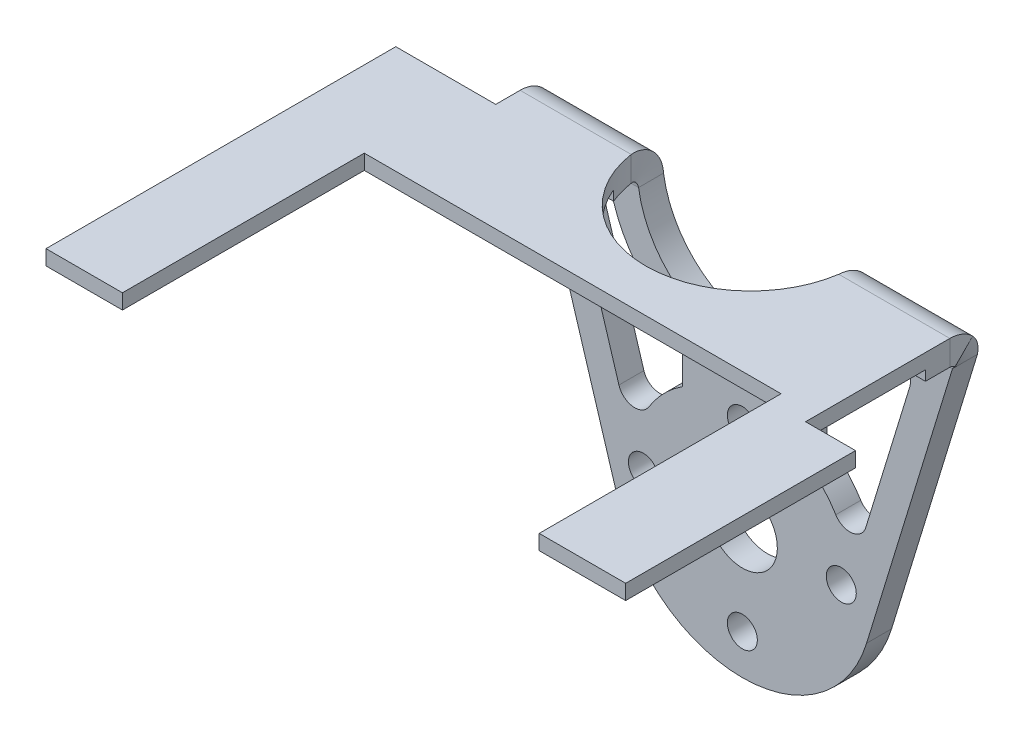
ISO-10303-21;
HEADER;
FILE_DESCRIPTION(('STEP AP214'),'2;1');
FILE_NAME('part.step','',(''),(''),'','','');
FILE_SCHEMA(('AUTOMOTIVE_DESIGN { 1 0 10303 214 1 1 1 1 }'));
ENDSEC;
DATA;
#1=APPLICATION_CONTEXT('core data for automotive mechanical design processes');
#2=APPLICATION_PROTOCOL_DEFINITION('international standard','automotive_design',2000,#1);
#3=PRODUCT_CONTEXT('',#1,'mechanical');
#4=PRODUCT('Part','Part','',(#3));
#5=PRODUCT_RELATED_PRODUCT_CATEGORY('part','',(#4));
#6=PRODUCT_DEFINITION_FORMATION('','',#4);
#7=PRODUCT_DEFINITION_CONTEXT('part definition',#1,'design');
#8=PRODUCT_DEFINITION('design','',#6,#7);
#9=PRODUCT_DEFINITION_SHAPE('','',#8);
#10=(LENGTH_UNIT() NAMED_UNIT(*) SI_UNIT(.MILLI.,.METRE.));
#11=(NAMED_UNIT(*) PLANE_ANGLE_UNIT() SI_UNIT($,.RADIAN.));
#12=(NAMED_UNIT(*) SI_UNIT($,.STERADIAN.) SOLID_ANGLE_UNIT());
#13=UNCERTAINTY_MEASURE_WITH_UNIT(LENGTH_MEASURE(1.E-05),#10,'distance_accuracy_value','');
#14=(GEOMETRIC_REPRESENTATION_CONTEXT(3) GLOBAL_UNCERTAINTY_ASSIGNED_CONTEXT((#13)) GLOBAL_UNIT_ASSIGNED_CONTEXT((#10,
#11,#12)) REPRESENTATION_CONTEXT('',''));
#15=CARTESIAN_POINT('',(0.,0.,0.));
#16=DIRECTION('',(0.,0.,1.));
#17=DIRECTION('',(1.,0.,0.));
#18=AXIS2_PLACEMENT_3D('',#15,#16,#17);
#19=CARTESIAN_POINT('',(2.5,0.,-58.8408591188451));
#20=DIRECTION('',(0.,1.,0.));
#21=DIRECTION('',(0.,0.,1.));
#22=AXIS2_PLACEMENT_3D('',#19,#20,#21);
#23=PLANE('',#22);
#24=DIRECTION('',(0.,0.,-1.));
#25=VECTOR('',#24,1.);
#26=CARTESIAN_POINT('',(24.,0.,0.));
#27=LINE('',#26,#25);
#28=CARTESIAN_POINT('',(24.,0.,-29.));
#29=VERTEX_POINT('',#28);
#30=CARTESIAN_POINT('',(24.,0.,-31.4397280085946));
#31=VERTEX_POINT('',#30);
#32=EDGE_CURVE('E787',#29,#31,#27,.T.);
#33=ORIENTED_EDGE('',*,*,#32,.F.);
#34=DIRECTION('',(1.,0.,0.));
#35=VECTOR('',#34,1.);
#36=CARTESIAN_POINT('',(-19.,0.,-29.));
#37=LINE('',#36,#35);
#38=CARTESIAN_POINT('',(12.2082439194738,0.,-29.));
#39=VERTEX_POINT('',#38);
#40=EDGE_CURVE('E1705',#39,#29,#37,.T.);
#41=ORIENTED_EDGE('',*,*,#40,.F.);
#42=CARTESIAN_POINT('',(2.5,0.,-33.));
#43=DIRECTION('',(0.,1.,0.));
#44=DIRECTION('',(0.,0.,1.));
#45=AXIS2_PLACEMENT_3D('',#42,#43,#44);
#46=CIRCLE('',#45,10.5);
#47=CARTESIAN_POINT('',(12.8834267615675,0.,-31.4397280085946));
#48=VERTEX_POINT('',#47);
#49=EDGE_CURVE('E72',#39,#48,#46,.T.);
#50=ORIENTED_EDGE('',*,*,#49,.T.);
#51=DIRECTION('',(1.,0.,0.));
#52=VECTOR('',#51,1.);
#53=CARTESIAN_POINT('',(2.50000000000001,0.,-31.4397280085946));
#54=LINE('',#53,#52);
#55=EDGE_CURVE('E574',#48,#31,#54,.T.);
#56=ORIENTED_EDGE('',*,*,#55,.T.);
#57=EDGE_LOOP('',(#33,#41,#50,#56));
#58=FACE_BOUND('',#57,.T.);
#59=ADVANCED_FACE('F67',(#58),#23,.F.);
#60=CARTESIAN_POINT('',(0.,1.,0.));
#61=DIRECTION('',(0.,1.,0.));
#62=DIRECTION('',(0.,0.,1.));
#63=AXIS2_PLACEMENT_3D('',#60,#61,#62);
#64=PLANE('',#63);
#65=DIRECTION('',(1.,0.,0.));
#66=VECTOR('',#65,1.);
#67=CARTESIAN_POINT('',(29.,1.,-17.));
#68=LINE('',#67,#66);
#69=CARTESIAN_POINT('',(-24.,1.,-17.));
#70=VERTEX_POINT('',#69);
#71=CARTESIAN_POINT('',(-21.35,1.,-17.));
#72=VERTEX_POINT('',#71);
#73=EDGE_CURVE('E321',#70,#72,#68,.T.);
#74=ORIENTED_EDGE('',*,*,#73,.T.);
#75=DIRECTION('',(0.,0.,1.));
#76=VECTOR('',#75,1.);
#77=CARTESIAN_POINT('',(-21.35,1.,0.));
#78=LINE('',#77,#76);
#79=CARTESIAN_POINT('',(-21.35,1.,6.));
#80=VERTEX_POINT('',#79);
#81=EDGE_CURVE('E356',#72,#80,#78,.T.);
#82=ORIENTED_EDGE('',*,*,#81,.T.);
#83=DIRECTION('',(1.,0.,0.));
#84=VECTOR('',#83,1.);
#85=CARTESIAN_POINT('',(-29.,1.,6.));
#86=LINE('',#85,#84);
#87=CARTESIAN_POINT('',(-29.,1.,6.));
#88=VERTEX_POINT('',#87);
#89=EDGE_CURVE('E380',#88,#80,#86,.T.);
#90=ORIENTED_EDGE('',*,*,#89,.F.);
#91=DIRECTION('',(0.,0.,-1.));
#92=VECTOR('',#91,1.);
#93=CARTESIAN_POINT('',(-29.,1.,-17.));
#94=LINE('',#93,#92);
#95=CARTESIAN_POINT('',(-29.,1.,-29.));
#96=VERTEX_POINT('',#95);
#97=EDGE_CURVE('E383',#88,#96,#94,.T.);
#98=ORIENTED_EDGE('',*,*,#97,.T.);
#99=DIRECTION('',(-1.,0.,0.));
#100=VECTOR('',#99,1.);
#101=CARTESIAN_POINT('',(-29.,1.,-29.));
#102=LINE('',#101,#100);
#103=CARTESIAN_POINT('',(-19.,1.,-29.));
#104=VERTEX_POINT('',#103);
#105=EDGE_CURVE('E338',#104,#96,#102,.T.);
#106=ORIENTED_EDGE('',*,*,#105,.F.);
#107=DIRECTION('',(0.384615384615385,0.,-0.923076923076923));
#108=VECTOR('',#107,1.);
#109=CARTESIAN_POINT('',(-19.,1.,-29.));
#110=LINE('',#109,#108);
#111=EDGE_CURVE('E325',#70,#104,#110,.T.);
#112=ORIENTED_EDGE('',*,*,#111,.F.);
#113=EDGE_LOOP('',(#74,#82,#90,#98,#106,#112));
#114=FACE_BOUND('',#113,.T.);
#115=ADVANCED_FACE('F336',(#114),#64,.F.);
#116=CARTESIAN_POINT('',(2.50000000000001,-25.0171871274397,-34.6763280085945));
#117=DIRECTION('',(0.,0.,-1.));
#118=DIRECTION('',(0.,1.,0.));
#119=AXIS2_PLACEMENT_3D('',#116,#117,#118);
#120=PLANE('',#119);
#121=CARTESIAN_POINT('',(12.4,-25.0171871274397,-34.6763280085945));
#122=DIRECTION('',(0.,0.,-1.));
#123=DIRECTION('',(0.,1.,0.));
#124=AXIS2_PLACEMENT_3D('',#121,#122,#123);
#125=CIRCLE('',#124,1.5);
#126=CARTESIAN_POINT('',(12.4,-23.5171871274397,-34.6763280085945));
#127=VERTEX_POINT('',#126);
#128=EDGE_CURVE('E781',#127,#127,#125,.T.);
#129=ORIENTED_EDGE('',*,*,#128,.F.);
#130=EDGE_LOOP('',(#129));
#131=FACE_BOUND('',#130,.T.);
#132=CARTESIAN_POINT('',(-7.4,-25.0171871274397,-34.6763280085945));
#133=DIRECTION('',(0.,0.,-1.));
#134=DIRECTION('',(0.,1.,0.));
#135=AXIS2_PLACEMENT_3D('',#132,#133,#134);
#136=CIRCLE('',#135,1.5);
#137=CARTESIAN_POINT('',(-7.4,-23.5171871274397,-34.6763280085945));
#138=VERTEX_POINT('',#137);
#139=EDGE_CURVE('E794',#138,#138,#136,.T.);
#140=ORIENTED_EDGE('',*,*,#139,.F.);
#141=EDGE_LOOP('',(#140));
#142=FACE_BOUND('',#141,.T.);
#143=DIRECTION('',(-0.292538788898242,-0.956253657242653,0.));
#144=VECTOR('',#143,1.);
#145=CARTESIAN_POINT('',(14.8494878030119,-18.8325615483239,-34.6763280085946));
#146=LINE('',#145,#144);
#147=CARTESIAN_POINT('',(19.2375696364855,-4.48875668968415,-34.6763280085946));
#148=VERTEX_POINT('',#147);
#149=CARTESIAN_POINT('',(14.8494878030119,-18.8325615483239,-34.6763280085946));
#150=VERTEX_POINT('',#149);
#151=EDGE_CURVE('E804',#148,#150,#146,.T.);
#152=ORIENTED_EDGE('',*,*,#151,.F.);
#153=CARTESIAN_POINT('',(17.2961168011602,-3.89482404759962,-34.6763280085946));
#154=DIRECTION('',(0.,0.,-1.));
#155=DIRECTION('',(0.,-1.,0.));
#156=AXIS2_PLACEMENT_3D('',#153,#154,#155);
#157=CIRCLE('',#156,2.03026970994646);
#158=CARTESIAN_POINT('',(15.3618227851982,-3.27797580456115,-34.6763280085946));
#159=VERTEX_POINT('',#158);
#160=EDGE_CURVE('E802',#159,#148,#157,.T.);
#161=ORIENTED_EDGE('',*,*,#160,.F.);
#162=CARTESIAN_POINT('',(2.5,0.823671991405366,-34.6763280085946));
#163=DIRECTION('',(0.,0.,1.));
#164=DIRECTION('',(0.,1.,0.));
#165=AXIS2_PLACEMENT_3D('',#162,#163,#164);
#166=CIRCLE('',#165,13.5);
#167=CARTESIAN_POINT('',(8.47558293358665,-11.2817982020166,-34.6763280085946));
#168=VERTEX_POINT('',#167);
#169=EDGE_CURVE('E814',#168,#159,#166,.T.);
#170=ORIENTED_EDGE('',*,*,#169,.F.);
#171=DIRECTION('',(0.,1.,0.));
#172=VECTOR('',#171,1.);
#173=CARTESIAN_POINT('',(8.47558293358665,-15.7817982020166,-34.6763280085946));
#174=LINE('',#173,#172);
#175=CARTESIAN_POINT('',(8.47558293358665,-15.7817982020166,-34.6763280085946));
#176=VERTEX_POINT('',#175);
#177=EDGE_CURVE('E811',#176,#168,#174,.T.);
#178=ORIENTED_EDGE('',*,*,#177,.F.);
#179=CARTESIAN_POINT('',(2.50000000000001,-25.0171871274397,-34.6763280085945));
#180=DIRECTION('',(0.,0.,1.));
#181=DIRECTION('',(0.,-1.,0.));
#182=AXIS2_PLACEMENT_3D('',#179,#180,#181);
#183=CIRCLE('',#182,11.);
#184=CARTESIAN_POINT('',(11.8494878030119,-19.2217511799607,-34.6763280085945));
#185=VERTEX_POINT('',#184);
#186=EDGE_CURVE('E809',#185,#176,#183,.T.);
#187=ORIENTED_EDGE('',*,*,#186,.F.);
#188=CARTESIAN_POINT('',(13.2612087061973,-18.3466724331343,-34.6763280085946));
#189=DIRECTION('',(0.,0.,-1.));
#190=DIRECTION('',(0.,1.,0.));
#191=AXIS2_PLACEMENT_3D('',#188,#189,#190);
#192=CIRCLE('',#191,1.66093910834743);
#193=EDGE_CURVE('E807',#150,#185,#192,.T.);
#194=ORIENTED_EDGE('',*,*,#193,.F.);
#195=EDGE_LOOP('',(#152,#161,#170,#178,#187,#194));
#196=FACE_BOUND('',#195,.T.);
#197=CARTESIAN_POINT('',(2.50000000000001,-25.0171871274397,-34.6763280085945));
#198=DIRECTION('',(0.,0.,-1.));
#199=DIRECTION('',(0.,1.,0.));
#200=AXIS2_PLACEMENT_3D('',#197,#198,#199);
#201=CIRCLE('',#200,3.5);
#202=CARTESIAN_POINT('',(2.5,-21.5171871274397,-34.6763280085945));
#203=VERTEX_POINT('',#202);
#204=EDGE_CURVE('E885',#203,#203,#201,.T.);
#205=ORIENTED_EDGE('',*,*,#204,.F.);
#206=EDGE_LOOP('',(#205));
#207=FACE_BOUND('',#206,.T.);
#208=DIRECTION('',(-0.292538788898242,0.956253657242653,0.));
#209=VECTOR('',#208,1.);
#210=CARTESIAN_POINT('',(-9.84948780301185,-18.8325615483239,-34.6763280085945));
#211=LINE('',#210,#209);
#212=CARTESIAN_POINT('',(-9.84948780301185,-18.8325615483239,-34.6763280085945));
#213=VERTEX_POINT('',#212);
#214=CARTESIAN_POINT('',(-14.2375696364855,-4.48875668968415,-34.6763280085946));
#215=VERTEX_POINT('',#214);
#216=EDGE_CURVE('E845',#213,#215,#211,.T.);
#217=ORIENTED_EDGE('',*,*,#216,.F.);
#218=CARTESIAN_POINT('',(-8.26120870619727,-18.3466724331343,-34.6763280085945));
#219=DIRECTION('',(0.,0.,-1.));
#220=DIRECTION('',(0.,-1.,0.));
#221=AXIS2_PLACEMENT_3D('',#218,#219,#220);
#222=CIRCLE('',#221,1.66093910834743);
#223=CARTESIAN_POINT('',(-6.84948780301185,-19.2217511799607,-34.6763280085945));
#224=VERTEX_POINT('',#223);
#225=EDGE_CURVE('E843',#224,#213,#222,.T.);
#226=ORIENTED_EDGE('',*,*,#225,.F.);
#227=CARTESIAN_POINT('',(2.50000000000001,-25.0171871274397,-34.6763280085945));
#228=DIRECTION('',(0.,0.,1.));
#229=DIRECTION('',(0.,1.,0.));
#230=AXIS2_PLACEMENT_3D('',#227,#228,#229);
#231=CIRCLE('',#230,11.);
#232=CARTESIAN_POINT('',(-3.47558293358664,-15.7817982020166,-34.6763280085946));
#233=VERTEX_POINT('',#232);
#234=EDGE_CURVE('E855',#233,#224,#231,.T.);
#235=ORIENTED_EDGE('',*,*,#234,.F.);
#236=DIRECTION('',(0.,-1.,0.));
#237=VECTOR('',#236,1.);
#238=CARTESIAN_POINT('',(-3.47558293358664,-15.7817982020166,-34.6763280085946));
#239=LINE('',#238,#237);
#240=CARTESIAN_POINT('',(-3.47558293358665,-11.2817982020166,-34.6763280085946));
#241=VERTEX_POINT('',#240);
#242=EDGE_CURVE('E852',#241,#233,#239,.T.);
#243=ORIENTED_EDGE('',*,*,#242,.F.);
#244=CARTESIAN_POINT('',(2.5,0.823671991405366,-34.6763280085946));
#245=DIRECTION('',(0.,0.,1.));
#246=DIRECTION('',(0.,-1.,0.));
#247=AXIS2_PLACEMENT_3D('',#244,#245,#246);
#248=CIRCLE('',#247,13.5);
#249=CARTESIAN_POINT('',(-10.3618227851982,-3.27797580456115,-34.6763280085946));
#250=VERTEX_POINT('',#249);
#251=EDGE_CURVE('E850',#250,#241,#248,.T.);
#252=ORIENTED_EDGE('',*,*,#251,.F.);
#253=CARTESIAN_POINT('',(-12.2961168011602,-3.89482404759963,-34.6763280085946));
#254=DIRECTION('',(0.,0.,-1.));
#255=DIRECTION('',(0.,1.,0.));
#256=AXIS2_PLACEMENT_3D('',#253,#254,#255);
#257=CIRCLE('',#256,2.03026970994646);
#258=EDGE_CURVE('E848',#215,#250,#257,.T.);
#259=ORIENTED_EDGE('',*,*,#258,.F.);
#260=EDGE_LOOP('',(#217,#226,#235,#243,#252,#259));
#261=FACE_BOUND('',#260,.T.);
#262=CARTESIAN_POINT('',(2.50000000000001,-34.0171871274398,-34.6763280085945));
#263=DIRECTION('',(0.,0.,-1.));
#264=DIRECTION('',(0.,1.,0.));
#265=AXIS2_PLACEMENT_3D('',#262,#263,#264);
#266=CIRCLE('',#265,1.5);
#267=CARTESIAN_POINT('',(2.50000000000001,-32.5171871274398,-34.6763280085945));
#268=VERTEX_POINT('',#267);
#269=EDGE_CURVE('E798',#268,#268,#266,.T.);
#270=ORIENTED_EDGE('',*,*,#269,.F.);
#271=EDGE_LOOP('',(#270));
#272=FACE_BOUND('',#271,.T.);
#273=CARTESIAN_POINT('',(2.5,-16.0171871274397,-34.6763280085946));
#274=DIRECTION('',(0.,0.,-1.));
#275=DIRECTION('',(0.,1.,0.));
#276=AXIS2_PLACEMENT_3D('',#273,#274,#275);
#277=CIRCLE('',#276,1.5);
#278=CARTESIAN_POINT('',(2.5,-14.5171871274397,-34.6763280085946));
#279=VERTEX_POINT('',#278);
#280=EDGE_CURVE('E790',#279,#279,#277,.T.);
#281=ORIENTED_EDGE('',*,*,#280,.F.);
#282=EDGE_LOOP('',(#281));
#283=FACE_BOUND('',#282,.T.);
#284=DIRECTION('',(-0.292538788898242,0.956253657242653,0.));
#285=VECTOR('',#284,1.);
#286=CARTESIAN_POINT('',(-9.93129754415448,-28.8201913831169,-34.6763280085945));
#287=LINE('',#286,#285);
#288=CARTESIAN_POINT('',(-9.93129754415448,-28.8201913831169,-34.6763280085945));
#289=VERTEX_POINT('',#288);
#290=CARTESIAN_POINT('',(-18.5226788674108,-0.736600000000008,-34.6763280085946));
#291=VERTEX_POINT('',#290);
#292=EDGE_CURVE('E716',#289,#291,#287,.T.);
#293=ORIENTED_EDGE('',*,*,#292,.T.);
#294=DIRECTION('',(1.,0.,0.));
#295=VECTOR('',#294,1.);
#296=CARTESIAN_POINT('',(2.50000000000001,-0.736600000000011,-34.6763280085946));
#297=LINE('',#296,#295);
#298=CARTESIAN_POINT('',(-7.88342676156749,-0.736600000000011,-34.6763280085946));
#299=VERTEX_POINT('',#298);
#300=EDGE_CURVE('E704',#291,#299,#297,.T.);
#301=ORIENTED_EDGE('',*,*,#300,.T.);
#302=CARTESIAN_POINT('',(2.5,0.823671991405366,-34.6763280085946));
#303=DIRECTION('',(0.,0.,-1.));
#304=DIRECTION('',(0.,1.,0.));
#305=AXIS2_PLACEMENT_3D('',#302,#303,#304);
#306=CIRCLE('',#305,10.5);
#307=CARTESIAN_POINT('',(12.8834267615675,-0.73660000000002,-34.6763280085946));
#308=VERTEX_POINT('',#307);
#309=EDGE_CURVE('E890',#308,#299,#306,.T.);
#310=ORIENTED_EDGE('',*,*,#309,.F.);
#311=DIRECTION('',(1.,0.,0.));
#312=VECTOR('',#311,1.);
#313=CARTESIAN_POINT('',(2.50000000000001,-0.736600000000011,-34.6763280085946));
#314=LINE('',#313,#312);
#315=CARTESIAN_POINT('',(23.5226788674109,-0.736600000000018,-34.6763280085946));
#316=VERTEX_POINT('',#315);
#317=EDGE_CURVE('E899',#308,#316,#314,.T.);
#318=ORIENTED_EDGE('',*,*,#317,.T.);
#319=DIRECTION('',(-0.292538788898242,-0.956253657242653,0.));
#320=VECTOR('',#319,1.);
#321=CARTESIAN_POINT('',(24.,0.823671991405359,-34.6763280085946));
#322=LINE('',#321,#320);
#323=CARTESIAN_POINT('',(14.9312975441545,-28.8201913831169,-34.6763280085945));
#324=VERTEX_POINT('',#323);
#325=EDGE_CURVE('E892',#316,#324,#322,.T.);
#326=ORIENTED_EDGE('',*,*,#325,.T.);
#327=CARTESIAN_POINT('',(2.50000000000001,-25.0171871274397,-34.6763280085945));
#328=DIRECTION('',(0.,0.,-1.));
#329=DIRECTION('',(0.,1.,0.));
#330=AXIS2_PLACEMENT_3D('',#327,#328,#329);
#331=CIRCLE('',#330,13.);
#332=EDGE_CURVE('E720',#324,#289,#331,.T.);
#333=ORIENTED_EDGE('',*,*,#332,.T.);
#334=EDGE_LOOP('',(#293,#301,#310,#318,#326,#333));
#335=FACE_BOUND('',#334,.T.);
#336=ADVANCED_FACE('F544',(#131,#142,#196,#207,#261,#272,#283,#335),#120,.T.);
#337=CARTESIAN_POINT('',(2.5,0.823671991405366,-34.6763280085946));
#338=DIRECTION('',(0.,0.,1.));
#339=DIRECTION('',(0.,-1.,0.));
#340=AXIS2_PLACEMENT_3D('',#337,#338,#339);
#341=CYLINDRICAL_SURFACE('',#340,10.5);
#342=ORIENTED_EDGE('',*,*,#309,.T.);
#343=CARTESIAN_POINT('',(-7.88342676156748,-0.736600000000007,-32.1763280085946));
#344=CARTESIAN_POINT('',(-7.88342676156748,-0.73660000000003,-34.6763280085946));
#345=B_SPLINE_CURVE_WITH_KNOTS('',1,(#343,#344),.UNSPECIFIED.,.F.,.F.,(2,2),(0.,1.),.UNSPECIFIED.);
#346=CARTESIAN_POINT('',(-7.88342676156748,-0.736600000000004,-32.1763280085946));
#347=VERTEX_POINT('',#346);
#348=EDGE_CURVE('E903',#299,#347,#345,.F.);
#349=ORIENTED_EDGE('',*,*,#348,.T.);
#350=CARTESIAN_POINT('',(2.5,0.823671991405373,-32.1763280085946));
#351=DIRECTION('',(0.,0.,-1.));
#352=DIRECTION('',(0.,1.,0.));
#353=AXIS2_PLACEMENT_3D('',#350,#351,#352);
#354=CIRCLE('',#353,10.5);
#355=CARTESIAN_POINT('',(12.8834267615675,-0.736600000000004,-32.1763280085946));
#356=VERTEX_POINT('',#355);
#357=EDGE_CURVE('E884',#356,#347,#354,.T.);
#358=ORIENTED_EDGE('',*,*,#357,.F.);
#359=CARTESIAN_POINT('',(12.8834267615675,-0.736600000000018,-34.6763280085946));
#360=CARTESIAN_POINT('',(12.8834267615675,-0.736600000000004,-32.1763280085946));
#361=B_SPLINE_CURVE_WITH_KNOTS('',1,(#359,#360),.UNSPECIFIED.,.F.,.F.,(2,2),(0.,1.),.UNSPECIFIED.);
#362=EDGE_CURVE('E902',#356,#308,#361,.F.);
#363=ORIENTED_EDGE('',*,*,#362,.T.);
#364=EDGE_LOOP('',(#342,#349,#358,#363));
#365=FACE_BOUND('',#364,.T.);
#366=ADVANCED_FACE('F69',(#365),#341,.F.);
#367=CARTESIAN_POINT('',(2.50000000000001,-25.0171871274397,-32.1763280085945));
#368=DIRECTION('',(0.,0.,-1.));
#369=DIRECTION('',(0.,1.,0.));
#370=AXIS2_PLACEMENT_3D('',#367,#368,#369);
#371=PLANE('',#370);
#372=DIRECTION('',(1.,0.,0.));
#373=VECTOR('',#372,1.);
#374=CARTESIAN_POINT('',(2.50000000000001,-0.736600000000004,-32.1763280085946));
#375=LINE('',#374,#373);
#376=CARTESIAN_POINT('',(-18.5226788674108,-0.736600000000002,-32.1763280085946));
#377=VERTEX_POINT('',#376);
#378=EDGE_CURVE('E750',#377,#347,#375,.T.);
#379=ORIENTED_EDGE('',*,*,#378,.F.);
#380=DIRECTION('',(-0.292538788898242,0.956253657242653,0.));
#381=VECTOR('',#380,1.);
#382=CARTESIAN_POINT('',(-9.93129754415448,-28.8201913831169,-32.1763280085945));
#383=LINE('',#382,#381);
#384=CARTESIAN_POINT('',(-9.93129754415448,-28.8201913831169,-32.1763280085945));
#385=VERTEX_POINT('',#384);
#386=EDGE_CURVE('E731',#385,#377,#383,.T.);
#387=ORIENTED_EDGE('',*,*,#386,.F.);
#388=CARTESIAN_POINT('',(2.50000000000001,-25.0171871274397,-32.1763280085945));
#389=DIRECTION('',(0.,0.,-1.));
#390=DIRECTION('',(0.,1.,0.));
#391=AXIS2_PLACEMENT_3D('',#388,#389,#390);
#392=CIRCLE('',#391,13.);
#393=CARTESIAN_POINT('',(14.9312975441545,-28.8201913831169,-32.1763280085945));
#394=VERTEX_POINT('',#393);
#395=EDGE_CURVE('E893',#394,#385,#392,.T.);
#396=ORIENTED_EDGE('',*,*,#395,.F.);
#397=DIRECTION('',(-0.292538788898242,-0.956253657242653,0.));
#398=VECTOR('',#397,1.);
#399=CARTESIAN_POINT('',(24.,0.823671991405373,-32.1763280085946));
#400=LINE('',#399,#398);
#401=CARTESIAN_POINT('',(23.5226788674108,-0.736600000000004,-32.1763280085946));
#402=VERTEX_POINT('',#401);
#403=EDGE_CURVE('E888',#402,#394,#400,.T.);
#404=ORIENTED_EDGE('',*,*,#403,.F.);
#405=DIRECTION('',(1.,0.,0.));
#406=VECTOR('',#405,1.);
#407=CARTESIAN_POINT('',(2.50000000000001,-0.736600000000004,-32.1763280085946));
#408=LINE('',#407,#406);
#409=EDGE_CURVE('E927',#356,#402,#408,.T.);
#410=ORIENTED_EDGE('',*,*,#409,.F.);
#411=ORIENTED_EDGE('',*,*,#357,.T.);
#412=EDGE_LOOP('',(#379,#387,#396,#404,#410,#411));
#413=FACE_BOUND('',#412,.T.);
#414=CARTESIAN_POINT('',(2.5,-16.0171871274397,-32.1763280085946));
#415=DIRECTION('',(0.,0.,-1.));
#416=DIRECTION('',(0.,1.,0.));
#417=AXIS2_PLACEMENT_3D('',#414,#415,#416);
#418=CIRCLE('',#417,1.5);
#419=CARTESIAN_POINT('',(2.5,-14.5171871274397,-32.1763280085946));
#420=VERTEX_POINT('',#419);
#421=EDGE_CURVE('E754',#420,#420,#418,.T.);
#422=ORIENTED_EDGE('',*,*,#421,.T.);
#423=EDGE_LOOP('',(#422));
#424=FACE_BOUND('',#423,.T.);
#425=CARTESIAN_POINT('',(2.50000000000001,-34.0171871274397,-32.1763280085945));
#426=DIRECTION('',(0.,0.,-1.));
#427=DIRECTION('',(0.,1.,0.));
#428=AXIS2_PLACEMENT_3D('',#425,#426,#427);
#429=CIRCLE('',#428,1.5);
#430=CARTESIAN_POINT('',(2.50000000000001,-32.5171871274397,-32.1763280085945));
#431=VERTEX_POINT('',#430);
#432=EDGE_CURVE('E758',#431,#431,#429,.T.);
#433=ORIENTED_EDGE('',*,*,#432,.T.);
#434=EDGE_LOOP('',(#433));
#435=FACE_BOUND('',#434,.T.);
#436=CARTESIAN_POINT('',(-8.26120870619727,-18.3466724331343,-32.1763280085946));
#437=DIRECTION('',(0.,0.,-1.));
#438=DIRECTION('',(0.,-1.,0.));
#439=AXIS2_PLACEMENT_3D('',#436,#437,#438);
#440=CIRCLE('',#439,1.66093910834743);
#441=CARTESIAN_POINT('',(-6.84948780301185,-19.2217511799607,-32.1763280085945));
#442=VERTEX_POINT('',#441);
#443=CARTESIAN_POINT('',(-9.84948780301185,-18.8325615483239,-32.1763280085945));
#444=VERTEX_POINT('',#443);
#445=EDGE_CURVE('E763',#442,#444,#440,.T.);
#446=ORIENTED_EDGE('',*,*,#445,.T.);
#447=DIRECTION('',(-0.292538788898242,0.956253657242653,0.));
#448=VECTOR('',#447,1.);
#449=CARTESIAN_POINT('',(-9.84948780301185,-18.8325615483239,-32.1763280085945));
#450=LINE('',#449,#448);
#451=CARTESIAN_POINT('',(-14.2375696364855,-4.48875668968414,-32.1763280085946));
#452=VERTEX_POINT('',#451);
#453=EDGE_CURVE('E859',#444,#452,#450,.T.);
#454=ORIENTED_EDGE('',*,*,#453,.T.);
#455=CARTESIAN_POINT('',(-12.2961168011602,-3.89482404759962,-32.1763280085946));
#456=DIRECTION('',(0.,0.,-1.));
#457=DIRECTION('',(0.,1.,0.));
#458=AXIS2_PLACEMENT_3D('',#455,#456,#457);
#459=CIRCLE('',#458,2.03026970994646);
#460=CARTESIAN_POINT('',(-10.3618227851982,-3.27797580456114,-32.1763280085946));
#461=VERTEX_POINT('',#460);
#462=EDGE_CURVE('E861',#452,#461,#459,.T.);
#463=ORIENTED_EDGE('',*,*,#462,.T.);
#464=CARTESIAN_POINT('',(2.5,0.823671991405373,-32.1763280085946));
#465=DIRECTION('',(0.,0.,1.));
#466=DIRECTION('',(0.,-1.,0.));
#467=AXIS2_PLACEMENT_3D('',#464,#465,#466);
#468=CIRCLE('',#467,13.5);
#469=CARTESIAN_POINT('',(-3.47558293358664,-11.2817982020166,-32.1763280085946));
#470=VERTEX_POINT('',#469);
#471=EDGE_CURVE('E864',#461,#470,#468,.T.);
#472=ORIENTED_EDGE('',*,*,#471,.T.);
#473=DIRECTION('',(0.,-1.,0.));
#474=VECTOR('',#473,1.);
#475=CARTESIAN_POINT('',(-3.47558293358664,-15.7817982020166,-32.1763280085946));
#476=LINE('',#475,#474);
#477=CARTESIAN_POINT('',(-3.47558293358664,-15.7817982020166,-32.1763280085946));
#478=VERTEX_POINT('',#477);
#479=EDGE_CURVE('E867',#470,#478,#476,.T.);
#480=ORIENTED_EDGE('',*,*,#479,.T.);
#481=CARTESIAN_POINT('',(2.50000000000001,-25.0171871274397,-32.1763280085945));
#482=DIRECTION('',(0.,0.,1.));
#483=DIRECTION('',(0.,1.,0.));
#484=AXIS2_PLACEMENT_3D('',#481,#482,#483);
#485=CIRCLE('',#484,11.);
#486=EDGE_CURVE('E846',#478,#442,#485,.T.);
#487=ORIENTED_EDGE('',*,*,#486,.T.);
#488=EDGE_LOOP('',(#446,#454,#463,#472,#480,#487));
#489=FACE_BOUND('',#488,.T.);
#490=CARTESIAN_POINT('',(2.50000000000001,-25.0171871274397,-32.1763280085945));
#491=DIRECTION('',(0.,0.,-1.));
#492=DIRECTION('',(0.,1.,0.));
#493=AXIS2_PLACEMENT_3D('',#490,#491,#492);
#494=CIRCLE('',#493,3.5);
#495=CARTESIAN_POINT('',(2.50000000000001,-21.5171871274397,-32.1763280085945));
#496=VERTEX_POINT('',#495);
#497=EDGE_CURVE('E767',#496,#496,#494,.T.);
#498=ORIENTED_EDGE('',*,*,#497,.T.);
#499=EDGE_LOOP('',(#498));
#500=FACE_BOUND('',#499,.T.);
#501=CARTESIAN_POINT('',(17.2961168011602,-3.89482404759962,-32.1763280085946));
#502=DIRECTION('',(0.,0.,-1.));
#503=DIRECTION('',(0.,-1.,0.));
#504=AXIS2_PLACEMENT_3D('',#501,#502,#503);
#505=CIRCLE('',#504,2.03026970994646);
#506=CARTESIAN_POINT('',(15.3618227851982,-3.27797580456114,-32.1763280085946));
#507=VERTEX_POINT('',#506);
#508=CARTESIAN_POINT('',(19.2375696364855,-4.48875668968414,-32.1763280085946));
#509=VERTEX_POINT('',#508);
#510=EDGE_CURVE('E772',#507,#509,#505,.T.);
#511=ORIENTED_EDGE('',*,*,#510,.T.);
#512=DIRECTION('',(-0.292538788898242,-0.956253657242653,0.));
#513=VECTOR('',#512,1.);
#514=CARTESIAN_POINT('',(14.8494878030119,-18.8325615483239,-32.1763280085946));
#515=LINE('',#514,#513);
#516=CARTESIAN_POINT('',(14.8494878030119,-18.8325615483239,-32.1763280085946));
#517=VERTEX_POINT('',#516);
#518=EDGE_CURVE('E818',#509,#517,#515,.T.);
#519=ORIENTED_EDGE('',*,*,#518,.T.);
#520=CARTESIAN_POINT('',(13.2612087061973,-18.3466724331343,-32.1763280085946));
#521=DIRECTION('',(0.,0.,-1.));
#522=DIRECTION('',(0.,1.,0.));
#523=AXIS2_PLACEMENT_3D('',#520,#521,#522);
#524=CIRCLE('',#523,1.66093910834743);
#525=CARTESIAN_POINT('',(11.8494878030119,-19.2217511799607,-32.1763280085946));
#526=VERTEX_POINT('',#525);
#527=EDGE_CURVE('E820',#517,#526,#524,.T.);
#528=ORIENTED_EDGE('',*,*,#527,.T.);
#529=CARTESIAN_POINT('',(2.50000000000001,-25.0171871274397,-32.1763280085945));
#530=DIRECTION('',(0.,0.,1.));
#531=DIRECTION('',(0.,-1.,0.));
#532=AXIS2_PLACEMENT_3D('',#529,#530,#531);
#533=CIRCLE('',#532,11.);
#534=CARTESIAN_POINT('',(8.47558293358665,-15.7817982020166,-32.1763280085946));
#535=VERTEX_POINT('',#534);
#536=EDGE_CURVE('E823',#526,#535,#533,.T.);
#537=ORIENTED_EDGE('',*,*,#536,.T.);
#538=DIRECTION('',(0.,1.,0.));
#539=VECTOR('',#538,1.);
#540=CARTESIAN_POINT('',(8.47558293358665,-15.7817982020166,-32.1763280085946));
#541=LINE('',#540,#539);
#542=CARTESIAN_POINT('',(8.47558293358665,-11.2817982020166,-32.1763280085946));
#543=VERTEX_POINT('',#542);
#544=EDGE_CURVE('E826',#535,#543,#541,.T.);
#545=ORIENTED_EDGE('',*,*,#544,.T.);
#546=CARTESIAN_POINT('',(2.5,0.823671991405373,-32.1763280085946));
#547=DIRECTION('',(0.,0.,1.));
#548=DIRECTION('',(0.,1.,0.));
#549=AXIS2_PLACEMENT_3D('',#546,#547,#548);
#550=CIRCLE('',#549,13.5);
#551=EDGE_CURVE('E805',#543,#507,#550,.T.);
#552=ORIENTED_EDGE('',*,*,#551,.T.);
#553=EDGE_LOOP('',(#511,#519,#528,#537,#545,#552));
#554=FACE_BOUND('',#553,.T.);
#555=CARTESIAN_POINT('',(-7.4,-25.0171871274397,-32.1763280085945));
#556=DIRECTION('',(0.,0.,-1.));
#557=DIRECTION('',(0.,1.,0.));
#558=AXIS2_PLACEMENT_3D('',#555,#556,#557);
#559=CIRCLE('',#558,1.5);
#560=CARTESIAN_POINT('',(-7.4,-23.5171871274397,-32.1763280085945));
#561=VERTEX_POINT('',#560);
#562=EDGE_CURVE('E776',#561,#561,#559,.T.);
#563=ORIENTED_EDGE('',*,*,#562,.T.);
#564=EDGE_LOOP('',(#563));
#565=FACE_BOUND('',#564,.T.);
#566=CARTESIAN_POINT('',(12.4,-25.0171871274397,-32.1763280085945));
#567=DIRECTION('',(0.,0.,-1.));
#568=DIRECTION('',(0.,1.,0.));
#569=AXIS2_PLACEMENT_3D('',#566,#567,#568);
#570=CIRCLE('',#569,1.5);
#571=CARTESIAN_POINT('',(12.4,-23.5171871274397,-32.1763280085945));
#572=VERTEX_POINT('',#571);
#573=EDGE_CURVE('E779',#572,#572,#570,.T.);
#574=ORIENTED_EDGE('',*,*,#573,.T.);
#575=EDGE_LOOP('',(#574));
#576=FACE_BOUND('',#575,.T.);
#577=ADVANCED_FACE('F694',(#413,#424,#435,#489,#500,#554,#565,#576),#371,.F.);
#578=CARTESIAN_POINT('',(24.,0.823671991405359,-34.6763280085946));
#579=DIRECTION('',(-0.956253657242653,0.292538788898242,0.));
#580=DIRECTION('',(0.292538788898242,0.956253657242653,0.));
#581=AXIS2_PLACEMENT_3D('',#578,#579,#580);
#582=PLANE('',#581);
#583=CARTESIAN_POINT('',(23.5226788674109,-0.736600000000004,-32.1763280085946));
#584=CARTESIAN_POINT('',(23.5226788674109,-0.736600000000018,-34.6763280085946));
#585=B_SPLINE_CURVE_WITH_KNOTS('',1,(#583,#584),.UNSPECIFIED.,.F.,.F.,(2,2),(0.,1.),.UNSPECIFIED.);
#586=EDGE_CURVE('E929',#402,#316,#585,.T.);
#587=ORIENTED_EDGE('',*,*,#586,.F.);
#588=ORIENTED_EDGE('',*,*,#403,.T.);
#589=DIRECTION('',(0.,0.,1.));
#590=VECTOR('',#589,1.);
#591=CARTESIAN_POINT('',(14.9312975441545,-28.8201913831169,-34.6763280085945));
#592=LINE('',#591,#590);
#593=EDGE_CURVE('E713',#324,#394,#592,.T.);
#594=ORIENTED_EDGE('',*,*,#593,.F.);
#595=ORIENTED_EDGE('',*,*,#325,.F.);
#596=EDGE_LOOP('',(#587,#588,#594,#595));
#597=FACE_BOUND('',#596,.T.);
#598=ADVANCED_FACE('F689',(#597),#582,.F.);
#599=CARTESIAN_POINT('',(2.50000000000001,-25.0171871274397,-34.6763280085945));
#600=DIRECTION('',(0.,0.,1.));
#601=DIRECTION('',(0.,-1.,0.));
#602=AXIS2_PLACEMENT_3D('',#599,#600,#601);
#603=CYLINDRICAL_SURFACE('',#602,13.);
#604=ORIENTED_EDGE('',*,*,#395,.T.);
#605=DIRECTION('',(0.,0.,1.));
#606=VECTOR('',#605,1.);
#607=CARTESIAN_POINT('',(-9.93129754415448,-28.8201913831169,-34.6763280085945));
#608=LINE('',#607,#606);
#609=EDGE_CURVE('E719',#289,#385,#608,.T.);
#610=ORIENTED_EDGE('',*,*,#609,.F.);
#611=ORIENTED_EDGE('',*,*,#332,.F.);
#612=ORIENTED_EDGE('',*,*,#593,.T.);
#613=EDGE_LOOP('',(#604,#610,#611,#612));
#614=FACE_BOUND('',#613,.T.);
#615=ADVANCED_FACE('F686',(#614),#603,.T.);
#616=CARTESIAN_POINT('',(-9.93129754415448,-28.8201913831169,-34.6763280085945));
#617=DIRECTION('',(0.956253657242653,0.292538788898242,0.));
#618=DIRECTION('',(0.292538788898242,-0.956253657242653,0.));
#619=AXIS2_PLACEMENT_3D('',#616,#617,#618);
#620=PLANE('',#619);
#621=CARTESIAN_POINT('',(-18.5226788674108,-0.736600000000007,-34.6763280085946));
#622=CARTESIAN_POINT('',(-18.5226788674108,-0.736600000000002,-32.1763280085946));
#623=B_SPLINE_CURVE_WITH_KNOTS('',1,(#621,#622),.UNSPECIFIED.,.F.,.F.,(2,2),(0.,1.),.UNSPECIFIED.);
#624=EDGE_CURVE('E712',#291,#377,#623,.T.);
#625=ORIENTED_EDGE('',*,*,#624,.F.);
#626=ORIENTED_EDGE('',*,*,#292,.F.);
#627=ORIENTED_EDGE('',*,*,#609,.T.);
#628=ORIENTED_EDGE('',*,*,#386,.T.);
#629=EDGE_LOOP('',(#625,#626,#627,#628));
#630=FACE_BOUND('',#629,.T.);
#631=ADVANCED_FACE('F684',(#630),#620,.F.);
#632=CARTESIAN_POINT('',(2.50000000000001,-25.0171871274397,-34.6763280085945));
#633=DIRECTION('',(0.,0.,1.));
#634=DIRECTION('',(0.,-1.,0.));
#635=AXIS2_PLACEMENT_3D('',#632,#633,#634);
#636=CYLINDRICAL_SURFACE('',#635,3.5);
#637=ORIENTED_EDGE('',*,*,#204,.T.);
#638=EDGE_LOOP('',(#637));
#639=FACE_BOUND('',#638,.T.);
#640=ORIENTED_EDGE('',*,*,#497,.F.);
#641=EDGE_LOOP('',(#640));
#642=FACE_BOUND('',#641,.T.);
#643=ADVANCED_FACE('F680',(#639,#642),#636,.F.);
#644=CARTESIAN_POINT('',(-8.26120870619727,-18.3466724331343,-34.6763280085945));
#645=DIRECTION('',(0.,0.,1.));
#646=DIRECTION('',(0.,-1.,0.));
#647=AXIS2_PLACEMENT_3D('',#644,#645,#646);
#648=CYLINDRICAL_SURFACE('',#647,1.66093910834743);
#649=ORIENTED_EDGE('',*,*,#445,.F.);
#650=DIRECTION('',(0.,0.,1.));
#651=VECTOR('',#650,1.);
#652=CARTESIAN_POINT('',(-6.84948780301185,-19.2217511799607,-34.6763280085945));
#653=LINE('',#652,#651);
#654=EDGE_CURVE('E857',#224,#442,#653,.T.);
#655=ORIENTED_EDGE('',*,*,#654,.F.);
#656=ORIENTED_EDGE('',*,*,#225,.T.);
#657=DIRECTION('',(0.,0.,1.));
#658=VECTOR('',#657,1.);
#659=CARTESIAN_POINT('',(-9.84948780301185,-18.8325615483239,-34.6763280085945));
#660=LINE('',#659,#658);
#661=EDGE_CURVE('E881',#213,#444,#660,.T.);
#662=ORIENTED_EDGE('',*,*,#661,.T.);
#663=EDGE_LOOP('',(#649,#655,#656,#662));
#664=FACE_BOUND('',#663,.T.);
#665=ADVANCED_FACE('F676',(#664),#648,.F.);
#666=CARTESIAN_POINT('',(-9.84948780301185,-18.8325615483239,-34.6763280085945));
#667=DIRECTION('',(0.956253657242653,0.292538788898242,0.));
#668=DIRECTION('',(0.292538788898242,-0.956253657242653,0.));
#669=AXIS2_PLACEMENT_3D('',#666,#667,#668);
#670=PLANE('',#669);
#671=ORIENTED_EDGE('',*,*,#453,.F.);
#672=ORIENTED_EDGE('',*,*,#661,.F.);
#673=ORIENTED_EDGE('',*,*,#216,.T.);
#674=DIRECTION('',(0.,0.,1.));
#675=VECTOR('',#674,1.);
#676=CARTESIAN_POINT('',(-14.2375696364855,-4.48875668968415,-34.6763280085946));
#677=LINE('',#676,#675);
#678=EDGE_CURVE('E879',#215,#452,#677,.T.);
#679=ORIENTED_EDGE('',*,*,#678,.T.);
#680=EDGE_LOOP('',(#671,#672,#673,#679));
#681=FACE_BOUND('',#680,.T.);
#682=ADVANCED_FACE('F672',(#681),#670,.T.);
#683=CARTESIAN_POINT('',(-12.2961168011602,-3.89482404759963,-34.6763280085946));
#684=DIRECTION('',(0.,0.,1.));
#685=DIRECTION('',(0.,-1.,0.));
#686=AXIS2_PLACEMENT_3D('',#683,#684,#685);
#687=CYLINDRICAL_SURFACE('',#686,2.03026970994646);
#688=ORIENTED_EDGE('',*,*,#462,.F.);
#689=ORIENTED_EDGE('',*,*,#678,.F.);
#690=ORIENTED_EDGE('',*,*,#258,.T.);
#691=DIRECTION('',(0.,0.,1.));
#692=VECTOR('',#691,1.);
#693=CARTESIAN_POINT('',(-10.3618227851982,-3.27797580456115,-34.6763280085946));
#694=LINE('',#693,#692);
#695=EDGE_CURVE('E877',#250,#461,#694,.T.);
#696=ORIENTED_EDGE('',*,*,#695,.T.);
#697=EDGE_LOOP('',(#688,#689,#690,#696));
#698=FACE_BOUND('',#697,.T.);
#699=ADVANCED_FACE('F668',(#698),#687,.F.);
#700=CARTESIAN_POINT('',(2.5,0.823671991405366,-34.6763280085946));
#701=DIRECTION('',(0.,0.,1.));
#702=DIRECTION('',(0.,-1.,0.));
#703=AXIS2_PLACEMENT_3D('',#700,#701,#702);
#704=CYLINDRICAL_SURFACE('',#703,13.5);
#705=ORIENTED_EDGE('',*,*,#471,.F.);
#706=ORIENTED_EDGE('',*,*,#695,.F.);
#707=ORIENTED_EDGE('',*,*,#251,.T.);
#708=DIRECTION('',(0.,0.,1.));
#709=VECTOR('',#708,1.);
#710=CARTESIAN_POINT('',(-3.47558293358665,-11.2817982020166,-34.6763280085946));
#711=LINE('',#710,#709);
#712=EDGE_CURVE('E875',#241,#470,#711,.T.);
#713=ORIENTED_EDGE('',*,*,#712,.T.);
#714=EDGE_LOOP('',(#705,#706,#707,#713));
#715=FACE_BOUND('',#714,.T.);
#716=ADVANCED_FACE('F664',(#715),#704,.T.);
#717=CARTESIAN_POINT('',(-3.47558293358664,-15.7817982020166,-34.6763280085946));
#718=DIRECTION('',(-1.,0.,0.));
#719=DIRECTION('',(0.,1.,0.));
#720=AXIS2_PLACEMENT_3D('',#717,#718,#719);
#721=PLANE('',#720);
#722=ORIENTED_EDGE('',*,*,#479,.F.);
#723=ORIENTED_EDGE('',*,*,#712,.F.);
#724=ORIENTED_EDGE('',*,*,#242,.T.);
#725=DIRECTION('',(0.,0.,1.));
#726=VECTOR('',#725,1.);
#727=CARTESIAN_POINT('',(-3.47558293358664,-15.7817982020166,-34.6763280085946));
#728=LINE('',#727,#726);
#729=EDGE_CURVE('E873',#233,#478,#728,.T.);
#730=ORIENTED_EDGE('',*,*,#729,.T.);
#731=EDGE_LOOP('',(#722,#723,#724,#730));
#732=FACE_BOUND('',#731,.T.);
#733=ADVANCED_FACE('F660',(#732),#721,.T.);
#734=CARTESIAN_POINT('',(2.50000000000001,-25.0171871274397,-34.6763280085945));
#735=DIRECTION('',(0.,0.,1.));
#736=DIRECTION('',(0.,-1.,0.));
#737=AXIS2_PLACEMENT_3D('',#734,#735,#736);
#738=CYLINDRICAL_SURFACE('',#737,11.);
#739=ORIENTED_EDGE('',*,*,#486,.F.);
#740=ORIENTED_EDGE('',*,*,#729,.F.);
#741=ORIENTED_EDGE('',*,*,#234,.T.);
#742=ORIENTED_EDGE('',*,*,#654,.T.);
#743=EDGE_LOOP('',(#739,#740,#741,#742));
#744=FACE_BOUND('',#743,.T.);
#745=ADVANCED_FACE('F656',(#744),#738,.T.);
#746=CARTESIAN_POINT('',(17.2961168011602,-3.89482404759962,-34.6763280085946));
#747=DIRECTION('',(0.,0.,1.));
#748=DIRECTION('',(0.,-1.,0.));
#749=AXIS2_PLACEMENT_3D('',#746,#747,#748);
#750=CYLINDRICAL_SURFACE('',#749,2.03026970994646);
#751=ORIENTED_EDGE('',*,*,#510,.F.);
#752=DIRECTION('',(0.,0.,1.));
#753=VECTOR('',#752,1.);
#754=CARTESIAN_POINT('',(15.3618227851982,-3.27797580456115,-34.6763280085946));
#755=LINE('',#754,#753);
#756=EDGE_CURVE('E816',#159,#507,#755,.T.);
#757=ORIENTED_EDGE('',*,*,#756,.F.);
#758=ORIENTED_EDGE('',*,*,#160,.T.);
#759=DIRECTION('',(0.,0.,1.));
#760=VECTOR('',#759,1.);
#761=CARTESIAN_POINT('',(19.2375696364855,-4.48875668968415,-34.6763280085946));
#762=LINE('',#761,#760);
#763=EDGE_CURVE('E840',#148,#509,#762,.T.);
#764=ORIENTED_EDGE('',*,*,#763,.T.);
#765=EDGE_LOOP('',(#751,#757,#758,#764));
#766=FACE_BOUND('',#765,.T.);
#767=ADVANCED_FACE('F652',(#766),#750,.F.);
#768=CARTESIAN_POINT('',(14.8494878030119,-18.8325615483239,-34.6763280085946));
#769=DIRECTION('',(-0.956253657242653,0.292538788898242,0.));
#770=DIRECTION('',(0.292538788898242,0.956253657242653,0.));
#771=AXIS2_PLACEMENT_3D('',#768,#769,#770);
#772=PLANE('',#771);
#773=ORIENTED_EDGE('',*,*,#518,.F.);
#774=ORIENTED_EDGE('',*,*,#763,.F.);
#775=ORIENTED_EDGE('',*,*,#151,.T.);
#776=DIRECTION('',(0.,0.,1.));
#777=VECTOR('',#776,1.);
#778=CARTESIAN_POINT('',(14.8494878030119,-18.8325615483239,-34.6763280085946));
#779=LINE('',#778,#777);
#780=EDGE_CURVE('E838',#150,#517,#779,.T.);
#781=ORIENTED_EDGE('',*,*,#780,.T.);
#782=EDGE_LOOP('',(#773,#774,#775,#781));
#783=FACE_BOUND('',#782,.T.);
#784=ADVANCED_FACE('F648',(#783),#772,.T.);
#785=CARTESIAN_POINT('',(13.2612087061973,-18.3466724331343,-34.6763280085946));
#786=DIRECTION('',(0.,0.,1.));
#787=DIRECTION('',(0.,-1.,0.));
#788=AXIS2_PLACEMENT_3D('',#785,#786,#787);
#789=CYLINDRICAL_SURFACE('',#788,1.66093910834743);
#790=ORIENTED_EDGE('',*,*,#527,.F.);
#791=ORIENTED_EDGE('',*,*,#780,.F.);
#792=ORIENTED_EDGE('',*,*,#193,.T.);
#793=DIRECTION('',(0.,0.,1.));
#794=VECTOR('',#793,1.);
#795=CARTESIAN_POINT('',(11.8494878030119,-19.2217511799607,-34.6763280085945));
#796=LINE('',#795,#794);
#797=EDGE_CURVE('E836',#185,#526,#796,.T.);
#798=ORIENTED_EDGE('',*,*,#797,.T.);
#799=EDGE_LOOP('',(#790,#791,#792,#798));
#800=FACE_BOUND('',#799,.T.);
#801=ADVANCED_FACE('F644',(#800),#789,.F.);
#802=CARTESIAN_POINT('',(2.50000000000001,-25.0171871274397,-34.6763280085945));
#803=DIRECTION('',(0.,0.,1.));
#804=DIRECTION('',(0.,-1.,0.));
#805=AXIS2_PLACEMENT_3D('',#802,#803,#804);
#806=CYLINDRICAL_SURFACE('',#805,11.);
#807=ORIENTED_EDGE('',*,*,#536,.F.);
#808=ORIENTED_EDGE('',*,*,#797,.F.);
#809=ORIENTED_EDGE('',*,*,#186,.T.);
#810=DIRECTION('',(0.,0.,1.));
#811=VECTOR('',#810,1.);
#812=CARTESIAN_POINT('',(8.47558293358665,-15.7817982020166,-34.6763280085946));
#813=LINE('',#812,#811);
#814=EDGE_CURVE('E834',#176,#535,#813,.T.);
#815=ORIENTED_EDGE('',*,*,#814,.T.);
#816=EDGE_LOOP('',(#807,#808,#809,#815));
#817=FACE_BOUND('',#816,.T.);
#818=ADVANCED_FACE('F640',(#817),#806,.T.);
#819=CARTESIAN_POINT('',(8.47558293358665,-15.7817982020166,-34.6763280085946));
#820=DIRECTION('',(1.,0.,0.));
#821=DIRECTION('',(0.,-1.,0.));
#822=AXIS2_PLACEMENT_3D('',#819,#820,#821);
#823=PLANE('',#822);
#824=ORIENTED_EDGE('',*,*,#544,.F.);
#825=ORIENTED_EDGE('',*,*,#814,.F.);
#826=ORIENTED_EDGE('',*,*,#177,.T.);
#827=DIRECTION('',(0.,0.,1.));
#828=VECTOR('',#827,1.);
#829=CARTESIAN_POINT('',(8.47558293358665,-11.2817982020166,-34.6763280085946));
#830=LINE('',#829,#828);
#831=EDGE_CURVE('E832',#168,#543,#830,.T.);
#832=ORIENTED_EDGE('',*,*,#831,.T.);
#833=EDGE_LOOP('',(#824,#825,#826,#832));
#834=FACE_BOUND('',#833,.T.);
#835=ADVANCED_FACE('F636',(#834),#823,.T.);
#836=CARTESIAN_POINT('',(2.5,0.823671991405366,-34.6763280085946));
#837=DIRECTION('',(0.,0.,1.));
#838=DIRECTION('',(0.,-1.,0.));
#839=AXIS2_PLACEMENT_3D('',#836,#837,#838);
#840=CYLINDRICAL_SURFACE('',#839,13.5);
#841=ORIENTED_EDGE('',*,*,#551,.F.);
#842=ORIENTED_EDGE('',*,*,#831,.F.);
#843=ORIENTED_EDGE('',*,*,#169,.T.);
#844=ORIENTED_EDGE('',*,*,#756,.T.);
#845=EDGE_LOOP('',(#841,#842,#843,#844));
#846=FACE_BOUND('',#845,.T.);
#847=ADVANCED_FACE('F632',(#846),#840,.T.);
#848=CARTESIAN_POINT('',(2.50000000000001,-34.0171871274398,-34.6763280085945));
#849=DIRECTION('',(0.,0.,1.));
#850=DIRECTION('',(0.,-1.,0.));
#851=AXIS2_PLACEMENT_3D('',#848,#849,#850);
#852=CYLINDRICAL_SURFACE('',#851,1.5);
#853=ORIENTED_EDGE('',*,*,#269,.T.);
#854=EDGE_LOOP('',(#853));
#855=FACE_BOUND('',#854,.T.);
#856=ORIENTED_EDGE('',*,*,#432,.F.);
#857=EDGE_LOOP('',(#856));
#858=FACE_BOUND('',#857,.T.);
#859=ADVANCED_FACE('F628',(#855,#858),#852,.F.);
#860=CARTESIAN_POINT('',(-7.4,-25.0171871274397,-34.6763280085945));
#861=DIRECTION('',(0.,0.,1.));
#862=DIRECTION('',(0.,-1.,0.));
#863=AXIS2_PLACEMENT_3D('',#860,#861,#862);
#864=CYLINDRICAL_SURFACE('',#863,1.5);
#865=ORIENTED_EDGE('',*,*,#139,.T.);
#866=EDGE_LOOP('',(#865));
#867=FACE_BOUND('',#866,.T.);
#868=ORIENTED_EDGE('',*,*,#562,.F.);
#869=EDGE_LOOP('',(#868));
#870=FACE_BOUND('',#869,.T.);
#871=ADVANCED_FACE('F624',(#867,#870),#864,.F.);
#872=CARTESIAN_POINT('',(2.5,-16.0171871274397,-34.6763280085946));
#873=DIRECTION('',(0.,0.,1.));
#874=DIRECTION('',(0.,-1.,0.));
#875=AXIS2_PLACEMENT_3D('',#872,#873,#874);
#876=CYLINDRICAL_SURFACE('',#875,1.5);
#877=ORIENTED_EDGE('',*,*,#280,.T.);
#878=EDGE_LOOP('',(#877));
#879=FACE_BOUND('',#878,.T.);
#880=ORIENTED_EDGE('',*,*,#421,.F.);
#881=EDGE_LOOP('',(#880));
#882=FACE_BOUND('',#881,.T.);
#883=ADVANCED_FACE('F620',(#879,#882),#876,.F.);
#884=CARTESIAN_POINT('',(12.4,-25.0171871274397,-34.6763280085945));
#885=DIRECTION('',(0.,0.,1.));
#886=DIRECTION('',(0.,-1.,0.));
#887=AXIS2_PLACEMENT_3D('',#884,#885,#886);
#888=CYLINDRICAL_SURFACE('',#887,1.5);
#889=ORIENTED_EDGE('',*,*,#128,.T.);
#890=EDGE_LOOP('',(#889));
#891=FACE_BOUND('',#890,.T.);
#892=ORIENTED_EDGE('',*,*,#573,.F.);
#893=EDGE_LOOP('',(#892));
#894=FACE_BOUND('',#893,.T.);
#895=ADVANCED_FACE('F617',(#891,#894),#888,.F.);
#896=CARTESIAN_POINT('',(2.5,2.5,-58.8408591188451));
#897=DIRECTION('',(0.,1.,0.));
#898=DIRECTION('',(0.,0.,1.));
#899=AXIS2_PLACEMENT_3D('',#896,#897,#898);
#900=PLANE('',#899);
#901=DIRECTION('',(0.,0.,1.));
#902=VECTOR('',#901,1.);
#903=CARTESIAN_POINT('',(-21.35,2.5,-18.2));
#904=LINE('',#903,#902);
#905=CARTESIAN_POINT('',(-21.35,2.5,-18.2));
#906=VERTEX_POINT('',#905);
#907=CARTESIAN_POINT('',(-21.35,2.5,6.));
#908=VERTEX_POINT('',#907);
#909=EDGE_CURVE('E352',#906,#908,#904,.T.);
#910=ORIENTED_EDGE('',*,*,#909,.F.);
#911=DIRECTION('',(-1.,0.,0.));
#912=VECTOR('',#911,1.);
#913=CARTESIAN_POINT('',(-20.35,2.5,-18.2));
#914=LINE('',#913,#912);
#915=CARTESIAN_POINT('',(20.35,2.5,-18.2));
#916=VERTEX_POINT('',#915);
#917=EDGE_CURVE('E358',#916,#906,#914,.T.);
#918=ORIENTED_EDGE('',*,*,#917,.F.);
#919=DIRECTION('',(0.,0.,-1.));
#920=VECTOR('',#919,1.);
#921=CARTESIAN_POINT('',(20.35,2.5,0.));
#922=LINE('',#921,#920);
#923=CARTESIAN_POINT('',(20.35,2.5,6.));
#924=VERTEX_POINT('',#923);
#925=EDGE_CURVE('E387',#924,#916,#922,.T.);
#926=ORIENTED_EDGE('',*,*,#925,.F.);
#927=DIRECTION('',(-1.,0.,0.));
#928=VECTOR('',#927,1.);
#929=CARTESIAN_POINT('',(29.,2.5,6.));
#930=LINE('',#929,#928);
#931=CARTESIAN_POINT('',(29.,2.5,6.));
#932=VERTEX_POINT('',#931);
#933=EDGE_CURVE('E363',#932,#924,#930,.T.);
#934=ORIENTED_EDGE('',*,*,#933,.F.);
#935=DIRECTION('',(0.,0.,-1.));
#936=VECTOR('',#935,1.);
#937=CARTESIAN_POINT('',(29.,2.5,0.));
#938=LINE('',#937,#936);
#939=CARTESIAN_POINT('',(29.,2.5,-17.));
#940=VERTEX_POINT('',#939);
#941=EDGE_CURVE('E390',#932,#940,#938,.T.);
#942=ORIENTED_EDGE('',*,*,#941,.T.);
#943=DIRECTION('',(-1.,0.,0.));
#944=VECTOR('',#943,1.);
#945=CARTESIAN_POINT('',(29.,2.5,-17.));
#946=LINE('',#945,#944);
#947=CARTESIAN_POINT('',(24.,2.5,-17.));
#948=VERTEX_POINT('',#947);
#949=EDGE_CURVE('E393',#940,#948,#946,.T.);
#950=ORIENTED_EDGE('',*,*,#949,.T.);
#951=DIRECTION('',(0.,0.,-1.));
#952=VECTOR('',#951,1.);
#953=CARTESIAN_POINT('',(24.,2.5,0.));
#954=LINE('',#953,#952);
#955=CARTESIAN_POINT('',(24.,2.5,-31.4397280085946));
#956=VERTEX_POINT('',#955);
#957=EDGE_CURVE('E985',#948,#956,#954,.T.);
#958=ORIENTED_EDGE('',*,*,#957,.T.);
#959=DIRECTION('',(1.,0.,0.));
#960=VECTOR('',#959,1.);
#961=CARTESIAN_POINT('',(2.50000000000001,2.5,-31.4397280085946));
#962=LINE('',#961,#960);
#963=CARTESIAN_POINT('',(12.8834267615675,2.5,-31.4397280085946));
#964=VERTEX_POINT('',#963);
#965=EDGE_CURVE('E590',#964,#956,#962,.T.);
#966=ORIENTED_EDGE('',*,*,#965,.F.);
#967=CARTESIAN_POINT('',(2.5,2.5,-33.));
#968=DIRECTION('',(0.,1.,0.));
#969=DIRECTION('',(0.,0.,1.));
#970=AXIS2_PLACEMENT_3D('',#967,#968,#969);
#971=CIRCLE('',#970,10.5);
#972=CARTESIAN_POINT('',(-7.88342676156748,2.5,-31.4397280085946));
#973=VERTEX_POINT('',#972);
#974=EDGE_CURVE('E577',#973,#964,#971,.T.);
#975=ORIENTED_EDGE('',*,*,#974,.F.);
#976=DIRECTION('',(1.,0.,0.));
#977=VECTOR('',#976,1.);
#978=CARTESIAN_POINT('',(2.50000000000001,2.5,-31.4397280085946));
#979=LINE('',#978,#977);
#980=CARTESIAN_POINT('',(-19.,2.5,-31.4397280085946));
#981=VERTEX_POINT('',#980);
#982=EDGE_CURVE('E1004',#981,#973,#979,.T.);
#983=ORIENTED_EDGE('',*,*,#982,.F.);
#984=DIRECTION('',(0.,0.,1.));
#985=VECTOR('',#984,1.);
#986=CARTESIAN_POINT('',(-19.,2.5,-33.));
#987=LINE('',#986,#985);
#988=CARTESIAN_POINT('',(-19.,2.5,-29.));
#989=VERTEX_POINT('',#988);
#990=EDGE_CURVE('E993',#981,#989,#987,.T.);
#991=ORIENTED_EDGE('',*,*,#990,.T.);
#992=DIRECTION('',(-1.,0.,0.));
#993=VECTOR('',#992,1.);
#994=CARTESIAN_POINT('',(-29.,2.5,-29.));
#995=LINE('',#994,#993);
#996=CARTESIAN_POINT('',(-29.,2.5,-29.));
#997=VERTEX_POINT('',#996);
#998=EDGE_CURVE('E340',#989,#997,#995,.T.);
#999=ORIENTED_EDGE('',*,*,#998,.T.);
#1000=DIRECTION('',(0.,0.,1.));
#1001=VECTOR('',#1000,1.);
#1002=CARTESIAN_POINT('',(-29.,2.5,0.));
#1003=LINE('',#1002,#1001);
#1004=CARTESIAN_POINT('',(-29.,2.5,6.));
#1005=VERTEX_POINT('',#1004);
#1006=EDGE_CURVE('E397',#997,#1005,#1003,.T.);
#1007=ORIENTED_EDGE('',*,*,#1006,.T.);
#1008=DIRECTION('',(-1.,0.,0.));
#1009=VECTOR('',#1008,1.);
#1010=CARTESIAN_POINT('',(-20.35,2.5,6.));
#1011=LINE('',#1010,#1009);
#1012=EDGE_CURVE('E375',#908,#1005,#1011,.T.);
#1013=ORIENTED_EDGE('',*,*,#1012,.F.);
#1014=EDGE_LOOP('',(#910,#918,#926,#934,#942,#950,#958,#966,#975,#983,#991,#999,#1007,#1013));
#1015=FACE_BOUND('',#1014,.T.);
#1016=ADVANCED_FACE('F560',(#1015),#900,.T.);
#1017=CARTESIAN_POINT('',(-19.,2.5,-33.));
#1018=DIRECTION('',(1.,0.,0.));
#1019=DIRECTION('',(0.,0.,-1.));
#1020=AXIS2_PLACEMENT_3D('',#1017,#1018,#1019);
#1021=PLANE('',#1020);
#1022=ORIENTED_EDGE('',*,*,#990,.F.);
#1023=DIRECTION('',(0.,-1.,0.));
#1024=VECTOR('',#1023,1.);
#1025=CARTESIAN_POINT('',(-19.,2.5,-31.4397280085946));
#1026=LINE('',#1025,#1024);
#1027=CARTESIAN_POINT('',(-19.,0.,-31.4397280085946));
#1028=VERTEX_POINT('',#1027);
#1029=EDGE_CURVE('E992',#981,#1028,#1026,.T.);
#1030=ORIENTED_EDGE('',*,*,#1029,.T.);
#1031=DIRECTION('',(0.,0.,1.));
#1032=VECTOR('',#1031,1.);
#1033=CARTESIAN_POINT('',(-19.,0.,-33.));
#1034=LINE('',#1033,#1032);
#1035=CARTESIAN_POINT('',(-19.,0.,-29.));
#1036=VERTEX_POINT('',#1035);
#1037=EDGE_CURVE('E587',#1028,#1036,#1034,.T.);
#1038=ORIENTED_EDGE('',*,*,#1037,.T.);
#1039=DIRECTION('',(0.,-1.,0.));
#1040=VECTOR('',#1039,1.);
#1041=CARTESIAN_POINT('',(-19.,2.5,-29.));
#1042=LINE('',#1041,#1040);
#1043=EDGE_CURVE('E1003',#104,#1036,#1042,.T.);
#1044=ORIENTED_EDGE('',*,*,#1043,.F.);
#1045=EDGE_CURVE('E998',#989,#104,#1042,.T.);
#1046=ORIENTED_EDGE('',*,*,#1045,.F.);
#1047=EDGE_LOOP('',(#1022,#1030,#1038,#1044,#1046));
#1048=FACE_BOUND('',#1047,.T.);
#1049=ADVANCED_FACE('F552',(#1048),#1021,.F.);
#1050=CARTESIAN_POINT('',(-7.88342676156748,0.,-31.4397280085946));
#1051=VERTEX_POINT('',#1050);
#1052=CARTESIAN_POINT('',(-7.2082439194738,0.,-29.));
#1053=VERTEX_POINT('',#1052);
#1054=EDGE_CURVE('E566',#1051,#1053,#46,.T.);
#1055=ORIENTED_EDGE('',*,*,#1054,.T.);
#1056=EDGE_CURVE('E568',#1036,#1053,#37,.T.);
#1057=ORIENTED_EDGE('',*,*,#1056,.F.);
#1058=ORIENTED_EDGE('',*,*,#1037,.F.);
#1059=DIRECTION('',(1.,0.,0.));
#1060=VECTOR('',#1059,1.);
#1061=CARTESIAN_POINT('',(2.50000000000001,0.,-31.4397280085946));
#1062=LINE('',#1061,#1060);
#1063=EDGE_CURVE('E571',#1028,#1051,#1062,.T.);
#1064=ORIENTED_EDGE('',*,*,#1063,.T.);
#1065=EDGE_LOOP('',(#1055,#1057,#1058,#1064));
#1066=FACE_BOUND('',#1065,.T.);
#1067=ADVANCED_FACE('F540',(#1066),#23,.F.);
#1068=CARTESIAN_POINT('',(2.5,2.5,-33.));
#1069=DIRECTION('',(0.,-1.,0.));
#1070=DIRECTION('',(0.,0.,-1.));
#1071=AXIS2_PLACEMENT_3D('',#1068,#1069,#1070);
#1072=CYLINDRICAL_SURFACE('',#1071,10.5);
#1073=DIRECTION('',(0.,-1.,0.));
#1074=VECTOR('',#1073,1.);
#1075=CARTESIAN_POINT('',(12.2082439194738,2.5,-29.));
#1076=LINE('',#1075,#1074);
#1077=CARTESIAN_POINT('',(12.2082439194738,1.,-29.));
#1078=VERTEX_POINT('',#1077);
#1079=EDGE_CURVE('E345',#1078,#39,#1076,.T.);
#1080=ORIENTED_EDGE('',*,*,#1079,.F.);
#1081=CARTESIAN_POINT('',(2.5,1.,-33.));
#1082=DIRECTION('',(0.,1.,0.));
#1083=DIRECTION('',(0.,0.,1.));
#1084=AXIS2_PLACEMENT_3D('',#1081,#1082,#1083);
#1085=CIRCLE('',#1084,10.5);
#1086=CARTESIAN_POINT('',(-7.2082439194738,1.,-29.));
#1087=VERTEX_POINT('',#1086);
#1088=EDGE_CURVE('E1720',#1087,#1078,#1085,.T.);
#1089=ORIENTED_EDGE('',*,*,#1088,.F.);
#1090=DIRECTION('',(0.,-1.,0.));
#1091=VECTOR('',#1090,1.);
#1092=CARTESIAN_POINT('',(-7.2082439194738,2.5,-29.));
#1093=LINE('',#1092,#1091);
#1094=EDGE_CURVE('E1708',#1053,#1087,#1093,.F.);
#1095=ORIENTED_EDGE('',*,*,#1094,.F.);
#1096=ORIENTED_EDGE('',*,*,#1054,.F.);
#1097=CARTESIAN_POINT('',(-7.88342676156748,2.5,-31.4397280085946));
#1098=CARTESIAN_POINT('',(-7.88342676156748,0.,-31.4397280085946));
#1099=B_SPLINE_CURVE_WITH_KNOTS('',1,(#1097,#1098),.UNSPECIFIED.,.F.,.F.,(2,2),(0.,1.),.UNSPECIFIED.);
#1100=EDGE_CURVE('E1006',#973,#1051,#1099,.T.);
#1101=ORIENTED_EDGE('',*,*,#1100,.F.);
#1102=ORIENTED_EDGE('',*,*,#974,.T.);
#1103=CARTESIAN_POINT('',(12.8834267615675,0.,-31.4397280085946));
#1104=CARTESIAN_POINT('',(12.8834267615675,2.5,-31.4397280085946));
#1105=B_SPLINE_CURVE_WITH_KNOTS('',1,(#1103,#1104),.UNSPECIFIED.,.F.,.F.,(2,2),(0.,1.),.UNSPECIFIED.);
#1106=EDGE_CURVE('E593',#48,#964,#1105,.T.);
#1107=ORIENTED_EDGE('',*,*,#1106,.F.);
#1108=ORIENTED_EDGE('',*,*,#49,.F.);
#1109=EDGE_LOOP('',(#1080,#1089,#1095,#1096,#1101,#1102,#1107,#1108));
#1110=FACE_BOUND('',#1109,.T.);
#1111=ADVANCED_FACE('F551',(#1110),#1072,.F.);
#1112=CARTESIAN_POINT('',(24.,2.5,0.));
#1113=DIRECTION('',(-1.,0.,0.));
#1114=DIRECTION('',(0.,0.,1.));
#1115=AXIS2_PLACEMENT_3D('',#1112,#1113,#1114);
#1116=PLANE('',#1115);
#1117=DIRECTION('',(0.,0.,1.));
#1118=VECTOR('',#1117,1.);
#1119=CARTESIAN_POINT('',(24.,1.,-29.));
#1120=LINE('',#1119,#1118);
#1121=CARTESIAN_POINT('',(24.,1.,-29.));
#1122=VERTEX_POINT('',#1121);
#1123=CARTESIAN_POINT('',(24.,1.,-17.));
#1124=VERTEX_POINT('',#1123);
#1125=EDGE_CURVE('E1712',#1122,#1124,#1120,.T.);
#1126=ORIENTED_EDGE('',*,*,#1125,.F.);
#1127=DIRECTION('',(0.,-1.,0.));
#1128=VECTOR('',#1127,1.);
#1129=CARTESIAN_POINT('',(24.,1.,-29.));
#1130=LINE('',#1129,#1128);
#1131=EDGE_CURVE('E1714',#1122,#29,#1130,.T.);
#1132=ORIENTED_EDGE('',*,*,#1131,.T.);
#1133=ORIENTED_EDGE('',*,*,#32,.T.);
#1134=DIRECTION('',(0.,1.,0.));
#1135=VECTOR('',#1134,1.);
#1136=CARTESIAN_POINT('',(24.,2.5,-31.4397280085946));
#1137=LINE('',#1136,#1135);
#1138=EDGE_CURVE('E782',#31,#956,#1137,.T.);
#1139=ORIENTED_EDGE('',*,*,#1138,.T.);
#1140=ORIENTED_EDGE('',*,*,#957,.F.);
#1141=DIRECTION('',(0.,1.,0.));
#1142=VECTOR('',#1141,1.);
#1143=CARTESIAN_POINT('',(24.,0.5,-17.));
#1144=LINE('',#1143,#1142);
#1145=EDGE_CURVE('E93',#1124,#948,#1144,.T.);
#1146=ORIENTED_EDGE('',*,*,#1145,.F.);
#1147=EDGE_LOOP('',(#1126,#1132,#1133,#1139,#1140,#1146));
#1148=FACE_BOUND('',#1147,.T.);
#1149=ADVANCED_FACE('F558',(#1148),#1116,.F.);
#1150=CARTESIAN_POINT('',(-18.5226788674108,-0.736600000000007,-34.6763280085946));
#1151=CARTESIAN_POINT('',(-18.6022462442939,-0.312856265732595,-34.6763280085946));
#1152=CARTESIAN_POINT('',(-18.6817859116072,0.110573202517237,-34.5920879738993));
#1153=CARTESIAN_POINT('',(-18.8408929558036,0.893413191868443,-34.267825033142));
#1154=CARTESIAN_POINT('',(-18.9204326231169,1.25238974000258,-34.0279818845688));
#1155=CARTESIAN_POINT('',(-19.,1.55202180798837,-33.728349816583));
#1156=CARTESIAN_POINT('',(-18.5226788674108,-0.736600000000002,-32.1763280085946));
#1157=CARTESIAN_POINT('',(-18.6022409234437,-0.640168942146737,-32.1763280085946));
#1158=CARTESIAN_POINT('',(-18.6817859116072,-0.543796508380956,-32.1571562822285));
#1159=CARTESIAN_POINT('',(-18.8408929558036,-0.365634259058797,-32.0833590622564));
#1160=CARTESIAN_POINT('',(-18.9204379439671,-0.283932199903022,-32.0287699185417));
#1161=CARTESIAN_POINT('',(-19.,-0.215745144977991,-31.9605828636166));
#1162=B_SPLINE_SURFACE_WITH_KNOTS('',1,3,((#1150,#1151,#1152,#1153,#1154,#1155),(#1156,#1157,
#1158,#1159,#1160,#1161)),.UNSPECIFIED.,.F.,.F.,.F.,(2,2),(4,2,4),(0.,1.),(0.,0.5,1.),.UNSPECIFIED.);
#1163=CARTESIAN_POINT('',(-18.5226788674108,-0.736600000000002,-32.1763280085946));
#1164=CARTESIAN_POINT('',(-18.6022409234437,-0.640168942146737,-32.1763280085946));
#1165=CARTESIAN_POINT('',(-18.6817859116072,-0.543796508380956,-32.1571562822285));
#1166=CARTESIAN_POINT('',(-18.8408929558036,-0.365634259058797,-32.0833590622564));
#1167=CARTESIAN_POINT('',(-18.9204379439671,-0.283932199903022,-32.0287699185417));
#1168=CARTESIAN_POINT('',(-19.,-0.215745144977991,-31.9605828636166));
#1169=B_SPLINE_CURVE_WITH_KNOTS('',3,(#1163,#1164,#1165,#1166,#1167,#1168),.UNSPECIFIED.,.F.,
.F.,(4,2,4),(0.,0.5,1.),.UNSPECIFIED.);
#1170=CARTESIAN_POINT('',(-19.,-0.215745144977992,-31.9605828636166));
#1171=VERTEX_POINT('',#1170);
#1172=EDGE_CURVE('E982',#377,#1171,#1169,.T.);
#1173=CARTESIAN_POINT('',(-19.,-0.215745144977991,-31.9605828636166));
#1174=CARTESIAN_POINT('',(-19.,1.55202180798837,-33.728349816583));
#1175=B_SPLINE_CURVE_WITH_KNOTS('',1,(#1173,#1174),.UNSPECIFIED.,.F.,.F.,(2,2),(0.,1.),.UNSPECIFIED.);
#1176=CARTESIAN_POINT('',(-19.,1.55202180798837,-33.728349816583));
#1177=VERTEX_POINT('',#1176);
#1178=EDGE_CURVE('E594',#1171,#1177,#1175,.T.);
#1179=CARTESIAN_POINT('',(-19.,1.55202180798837,-33.728349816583));
#1180=CARTESIAN_POINT('',(-18.9204326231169,1.25238974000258,-34.0279818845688));
#1181=CARTESIAN_POINT('',(-18.8408929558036,0.893413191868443,-34.267825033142));
#1182=CARTESIAN_POINT('',(-18.6817859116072,0.110573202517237,-34.5920879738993));
#1183=CARTESIAN_POINT('',(-18.6022462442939,-0.312856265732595,-34.6763280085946));
#1184=CARTESIAN_POINT('',(-18.5226788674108,-0.736600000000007,-34.6763280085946));
#1185=B_SPLINE_CURVE_WITH_KNOTS('',3,(#1179,#1180,#1181,#1182,#1183,#1184),.UNSPECIFIED.,.F.,
.F.,(4,2,4),(0.,0.5,1.),.UNSPECIFIED.);
#1186=EDGE_CURVE('E1118',#291,#1177,#1185,.F.);
#1187=ORIENTED_EDGE('',*,*,#624,.T.);
#1188=ORIENTED_EDGE('',*,*,#1172,.T.);
#1189=ORIENTED_EDGE('',*,*,#1178,.T.);
#1190=ORIENTED_EDGE('',*,*,#1186,.F.);
#1191=EDGE_LOOP('',(#1187,#1188,#1189,#1190));
#1192=FACE_BOUND('',#1191,.T.);
#1193=ADVANCED_FACE('F615',(#1192),#1162,.T.);
#1194=CARTESIAN_POINT('',(-19.,-0.7366,-31.4397280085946));
#1195=DIRECTION('',(-1.,0.,0.));
#1196=DIRECTION('',(0.,0.,1.));
#1197=AXIS2_PLACEMENT_3D('',#1194,#1195,#1196);
#1198=PLANE('',#1197);
#1199=ORIENTED_EDGE('',*,*,#1178,.F.);
#1200=CARTESIAN_POINT('',(-19.,-0.7366,-31.4397280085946));
#1201=DIRECTION('',(-1.,0.,0.));
#1202=DIRECTION('',(0.,0.,1.));
#1203=AXIS2_PLACEMENT_3D('',#1200,#1201,#1202);
#1204=CIRCLE('',#1203,0.7366);
#1205=EDGE_CURVE('E1131',#1171,#1028,#1204,.F.);
#1206=ORIENTED_EDGE('',*,*,#1205,.T.);
#1207=ORIENTED_EDGE('',*,*,#1029,.F.);
#1208=CARTESIAN_POINT('',(-19.,-0.7366,-31.4397280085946));
#1209=DIRECTION('',(1.,0.,0.));
#1210=DIRECTION('',(0.,0.,-1.));
#1211=AXIS2_PLACEMENT_3D('',#1208,#1209,#1210);
#1212=CIRCLE('',#1211,3.2366);
#1213=EDGE_CURVE('E1114',#1177,#981,#1212,.T.);
#1214=ORIENTED_EDGE('',*,*,#1213,.F.);
#1215=EDGE_LOOP('',(#1199,#1206,#1207,#1214));
#1216=FACE_BOUND('',#1215,.T.);
#1217=ADVANCED_FACE('F1037',(#1216),#1198,.T.);
#1218=CARTESIAN_POINT('',(-7.88342676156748,2.5,-31.4397280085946));
#1219=CARTESIAN_POINT('',(-7.9113676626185,2.5,-31.8174057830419));
#1220=CARTESIAN_POINT('',(-7.93235272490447,2.43303291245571,-32.2076064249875));
#1221=CARTESIAN_POINT('',(-7.9603104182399,2.14999550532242,-32.9575476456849));
#1222=CARTESIAN_POINT('',(-7.96729984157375,1.9336226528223,-33.3172228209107));
#1223=CARTESIAN_POINT('',(-7.96729984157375,1.36041040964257,-33.9412521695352));
#1224=CARTESIAN_POINT('',(-7.9603104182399,1.00339992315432,-34.2051193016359));
#1225=CARTESIAN_POINT('',(-7.93235272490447,0.189567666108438,-34.5729694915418));
#1226=CARTESIAN_POINT('',(-7.91141328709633,-0.266680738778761,-34.6763280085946));
#1227=CARTESIAN_POINT('',(-7.88342676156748,-0.73660000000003,-34.6763280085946));
#1228=CARTESIAN_POINT('',(-7.88342676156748,0.,-31.4397280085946));
#1229=CARTESIAN_POINT('',(-7.91136918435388,0.,-31.525686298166));
#1230=CARTESIAN_POINT('',(-7.93235272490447,-0.0152406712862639,-31.6144852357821));
#1231=CARTESIAN_POINT('',(-7.9603104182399,-0.0796555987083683,-31.7851602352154));
#1232=CARTESIAN_POINT('',(-7.96729984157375,-0.128898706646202,-31.8670167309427));
#1233=CARTESIAN_POINT('',(-7.96729984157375,-0.259352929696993,-32.0090361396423));
#1234=CARTESIAN_POINT('',(-7.96031041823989,-0.340602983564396,-32.069088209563));
#1235=CARTESIAN_POINT('',(-7.93235272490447,-0.525818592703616,-32.1528052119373));
#1236=CARTESIAN_POINT('',(-7.9114115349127,-0.629660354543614,-32.1763280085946));
#1237=CARTESIAN_POINT('',(-7.88342676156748,-0.736600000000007,-32.1763280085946));
#1238=B_SPLINE_SURFACE_WITH_KNOTS('',1,3,((#1218,#1219,#1220,#1221,#1222,#1223,#1224,#1225,
#1226,#1227),(#1228,#1229,#1230,#1231,#1232,#1233,#1234,#1235,#1236,#1237)),.UNSPECIFIED.,.F.,
.F.,.F.,(2,2),(4,2,2,2,4),(0.,1.),(0.,0.25,0.5,0.75,1.),.UNSPECIFIED.);
#1239=CARTESIAN_POINT('',(-7.88342676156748,0.,-31.4397280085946));
#1240=CARTESIAN_POINT('',(-7.91136918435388,0.,-31.525686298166));
#1241=CARTESIAN_POINT('',(-7.93235272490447,-0.0152406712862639,-31.6144852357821));
#1242=CARTESIAN_POINT('',(-7.9603104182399,-0.0796555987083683,-31.7851602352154));
#1243=CARTESIAN_POINT('',(-7.96729984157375,-0.128898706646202,-31.8670167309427));
#1244=CARTESIAN_POINT('',(-7.96729984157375,-0.259352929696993,-32.0090361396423));
#1245=CARTESIAN_POINT('',(-7.96031041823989,-0.340602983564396,-32.069088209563));
#1246=CARTESIAN_POINT('',(-7.93235272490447,-0.525818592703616,-32.1528052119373));
#1247=CARTESIAN_POINT('',(-7.9114115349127,-0.629660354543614,-32.1763280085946));
#1248=CARTESIAN_POINT('',(-7.88342676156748,-0.736600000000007,-32.1763280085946));
#1249=B_SPLINE_CURVE_WITH_KNOTS('',3,(#1239,#1240,#1241,#1242,#1243,#1244,#1245,#1246,#1247,
#1248),.UNSPECIFIED.,.F.,.F.,(4,2,2,2,4),(0.,0.25,0.5,0.75,1.),.UNSPECIFIED.);
#1250=EDGE_CURVE('E1122',#1051,#347,#1249,.T.);
#1251=CARTESIAN_POINT('',(-7.88342676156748,-0.73660000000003,-34.6763280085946));
#1252=CARTESIAN_POINT('',(-7.91141328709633,-0.266680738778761,-34.6763280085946));
#1253=CARTESIAN_POINT('',(-7.93235272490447,0.189567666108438,-34.5729694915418));
#1254=CARTESIAN_POINT('',(-7.9603104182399,1.00339992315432,-34.2051193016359));
#1255=CARTESIAN_POINT('',(-7.96729984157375,1.36041040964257,-33.9412521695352));
#1256=CARTESIAN_POINT('',(-7.96729984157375,1.9336226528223,-33.3172228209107));
#1257=CARTESIAN_POINT('',(-7.9603104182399,2.14999550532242,-32.9575476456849));
#1258=CARTESIAN_POINT('',(-7.93235272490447,2.43303291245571,-32.2076064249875));
#1259=CARTESIAN_POINT('',(-7.9113676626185,2.5,-31.8174057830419));
#1260=CARTESIAN_POINT('',(-7.88342676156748,2.5,-31.4397280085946));
#1261=B_SPLINE_CURVE_WITH_KNOTS('',3,(#1251,#1252,#1253,#1254,#1255,#1256,#1257,#1258,#1259,
#1260),.UNSPECIFIED.,.F.,.F.,(4,2,2,2,4),(0.,0.25,0.5,0.75,1.),.UNSPECIFIED.);
#1262=EDGE_CURVE('E1111',#973,#299,#1261,.F.);
#1263=ORIENTED_EDGE('',*,*,#1250,.T.);
#1264=ORIENTED_EDGE('',*,*,#348,.F.);
#1265=ORIENTED_EDGE('',*,*,#1262,.F.);
#1266=ORIENTED_EDGE('',*,*,#1100,.T.);
#1267=EDGE_LOOP('',(#1263,#1264,#1265,#1266));
#1268=FACE_BOUND('',#1267,.T.);
#1269=ADVANCED_FACE('F1025',(#1268),#1238,.T.);
#1270=CARTESIAN_POINT('',(-1.62790809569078,-0.7366,-31.4397280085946));
#1271=DIRECTION('',(-1.,0.,0.));
#1272=DIRECTION('',(0.,0.,1.));
#1273=AXIS2_PLACEMENT_3D('',#1270,#1271,#1272);
#1274=CYLINDRICAL_SURFACE('',#1273,3.2366);
#1275=ORIENTED_EDGE('',*,*,#982,.T.);
#1276=ORIENTED_EDGE('',*,*,#1262,.T.);
#1277=ORIENTED_EDGE('',*,*,#300,.F.);
#1278=ORIENTED_EDGE('',*,*,#1186,.T.);
#1279=ORIENTED_EDGE('',*,*,#1213,.T.);
#1280=EDGE_LOOP('',(#1275,#1276,#1277,#1278,#1279));
#1281=FACE_BOUND('',#1280,.T.);
#1282=ADVANCED_FACE('F491',(#1281),#1274,.T.);
#1283=CARTESIAN_POINT('',(-1.62790809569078,-0.7366,-31.4397280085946));
#1284=DIRECTION('',(-1.,0.,0.));
#1285=DIRECTION('',(0.,0.,1.));
#1286=AXIS2_PLACEMENT_3D('',#1283,#1284,#1285);
#1287=CYLINDRICAL_SURFACE('',#1286,0.7366);
#1288=ORIENTED_EDGE('',*,*,#1063,.F.);
#1289=ORIENTED_EDGE('',*,*,#1205,.F.);
#1290=ORIENTED_EDGE('',*,*,#1172,.F.);
#1291=ORIENTED_EDGE('',*,*,#378,.T.);
#1292=ORIENTED_EDGE('',*,*,#1250,.F.);
#1293=EDGE_LOOP('',(#1288,#1289,#1290,#1291,#1292));
#1294=FACE_BOUND('',#1293,.T.);
#1295=ADVANCED_FACE('F534',(#1294),#1287,.F.);
#1296=CARTESIAN_POINT('',(12.8834267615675,-0.736600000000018,-34.6763280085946));
#1297=CARTESIAN_POINT('',(12.9113676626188,-0.358922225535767,-34.6763280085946));
#1298=CARTESIAN_POINT('',(12.9323527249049,0.0312784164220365,-34.6093609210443));
#1299=CARTESIAN_POINT('',(12.9603104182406,0.781219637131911,-34.3263235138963));
#1300=CARTESIAN_POINT('',(12.9672998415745,1.14089481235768,-34.1099506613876));
#1301=CARTESIAN_POINT('',(12.9672998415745,1.76492416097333,-33.5367384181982));
#1302=CARTESIAN_POINT('',(12.9603104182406,2.02879129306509,-33.1797279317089));
#1303=CARTESIAN_POINT('',(12.9323527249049,2.3966414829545,-32.3658956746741));
#1304=CARTESIAN_POINT('',(12.9114132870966,2.5,-31.9096472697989));
#1305=CARTESIAN_POINT('',(12.8834267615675,2.5,-31.4397280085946));
#1306=CARTESIAN_POINT('',(12.8834267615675,-0.736600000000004,-32.1763280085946));
#1307=CARTESIAN_POINT('',(12.9113691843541,-0.650641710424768,-32.1763280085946));
#1308=CARTESIAN_POINT('',(12.9323527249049,-0.561842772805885,-32.161087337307));
#1309=CARTESIAN_POINT('',(12.9603104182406,-0.391167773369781,-32.0966724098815));
#1310=CARTESIAN_POINT('',(12.9672998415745,-0.30931127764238,-32.0474293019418));
#1311=CARTESIAN_POINT('',(12.9672998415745,-0.167291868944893,-31.9169750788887));
#1312=CARTESIAN_POINT('',(12.9603104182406,-0.107239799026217,-31.8357250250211));
#1313=CARTESIAN_POINT('',(12.9323527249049,-0.0235227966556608,-31.6505094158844));
#1314=CARTESIAN_POINT('',(12.911411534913,0.,-31.5466676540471));
#1315=CARTESIAN_POINT('',(12.8834267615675,0.,-31.4397280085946));
#1316=B_SPLINE_SURFACE_WITH_KNOTS('',1,3,((#1296,#1297,#1298,#1299,#1300,#1301,#1302,#1303,
#1304,#1305),(#1306,#1307,#1308,#1309,#1310,#1311,#1312,#1313,#1314,#1315)),.UNSPECIFIED.,.F.,
.F.,.F.,(2,2),(4,2,2,2,4),(0.,1.),(0.,0.25,0.5,0.75,1.),.UNSPECIFIED.);
#1317=CARTESIAN_POINT('',(12.8834267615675,-0.736600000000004,-32.1763280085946));
#1318=CARTESIAN_POINT('',(12.9113691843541,-0.650641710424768,-32.1763280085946));
#1319=CARTESIAN_POINT('',(12.9323527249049,-0.561842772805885,-32.161087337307));
#1320=CARTESIAN_POINT('',(12.9603104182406,-0.391167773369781,-32.0966724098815));
#1321=CARTESIAN_POINT('',(12.9672998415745,-0.30931127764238,-32.0474293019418));
#1322=CARTESIAN_POINT('',(12.9672998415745,-0.167291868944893,-31.9169750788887));
#1323=CARTESIAN_POINT('',(12.9603104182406,-0.107239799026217,-31.8357250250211));
#1324=CARTESIAN_POINT('',(12.9323527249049,-0.0235227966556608,-31.6505094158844));
#1325=CARTESIAN_POINT('',(12.911411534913,0.,-31.5466676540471));
#1326=CARTESIAN_POINT('',(12.8834267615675,0.,-31.4397280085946));
#1327=B_SPLINE_CURVE_WITH_KNOTS('',3,(#1317,#1318,#1319,#1320,#1321,#1322,#1323,#1324,#1325,
#1326),.UNSPECIFIED.,.F.,.F.,(4,2,2,2,4),(0.,0.25,0.5,0.75,1.),.UNSPECIFIED.);
#1328=EDGE_CURVE('E401',#356,#48,#1327,.T.);
#1329=CARTESIAN_POINT('',(12.8834267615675,2.5,-31.4397280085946));
#1330=CARTESIAN_POINT('',(12.9114132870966,2.5,-31.9096472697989));
#1331=CARTESIAN_POINT('',(12.9323527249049,2.3966414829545,-32.3658956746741));
#1332=CARTESIAN_POINT('',(12.9603104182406,2.02879129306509,-33.1797279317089));
#1333=CARTESIAN_POINT('',(12.9672998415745,1.76492416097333,-33.5367384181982));
#1334=CARTESIAN_POINT('',(12.9672998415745,1.14089481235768,-34.1099506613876));
#1335=CARTESIAN_POINT('',(12.9603104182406,0.781219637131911,-34.3263235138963));
#1336=CARTESIAN_POINT('',(12.9323527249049,0.0312784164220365,-34.6093609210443));
#1337=CARTESIAN_POINT('',(12.9113676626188,-0.358922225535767,-34.6763280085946));
#1338=CARTESIAN_POINT('',(12.8834267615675,-0.736600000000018,-34.6763280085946));
#1339=B_SPLINE_CURVE_WITH_KNOTS('',3,(#1329,#1330,#1331,#1332,#1333,#1334,#1335,#1336,#1337,
#1338),.UNSPECIFIED.,.F.,.F.,(4,2,2,2,4),(0.,0.25,0.5,0.75,1.),.UNSPECIFIED.);
#1340=EDGE_CURVE('E447',#308,#964,#1339,.F.);
#1341=ORIENTED_EDGE('',*,*,#362,.F.);
#1342=ORIENTED_EDGE('',*,*,#1328,.T.);
#1343=ORIENTED_EDGE('',*,*,#1106,.T.);
#1344=ORIENTED_EDGE('',*,*,#1340,.F.);
#1345=EDGE_LOOP('',(#1341,#1342,#1343,#1344));
#1346=FACE_BOUND('',#1345,.T.);
#1347=ADVANCED_FACE('F487',(#1346),#1316,.T.);
#1348=CARTESIAN_POINT('',(24.,-0.7366,-31.4397280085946));
#1349=DIRECTION('',(1.,0.,0.));
#1350=DIRECTION('',(0.,0.,-1.));
#1351=AXIS2_PLACEMENT_3D('',#1348,#1349,#1350);
#1352=PLANE('',#1351);
#1353=ORIENTED_EDGE('',*,*,#1138,.F.);
#1354=CARTESIAN_POINT('',(24.,-0.7366,-31.4397280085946));
#1355=DIRECTION('',(-1.,0.,0.));
#1356=DIRECTION('',(0.,0.,1.));
#1357=AXIS2_PLACEMENT_3D('',#1354,#1355,#1356);
#1358=CIRCLE('',#1357,0.7366);
#1359=CARTESIAN_POINT('',(24.,-0.215745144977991,-31.9605828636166));
#1360=VERTEX_POINT('',#1359);
#1361=EDGE_CURVE('E459',#31,#1360,#1358,.T.);
#1362=ORIENTED_EDGE('',*,*,#1361,.T.);
#1363=CARTESIAN_POINT('',(24.,1.55202180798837,-33.728349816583));
#1364=CARTESIAN_POINT('',(24.,-0.215745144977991,-31.9605828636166));
#1365=B_SPLINE_CURVE_WITH_KNOTS('',1,(#1363,#1364),.UNSPECIFIED.,.F.,.F.,(2,2),(0.,1.),.UNSPECIFIED.);
#1366=CARTESIAN_POINT('',(24.,1.55202180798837,-33.728349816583));
#1367=VERTEX_POINT('',#1366);
#1368=EDGE_CURVE('E520',#1360,#1367,#1365,.F.);
#1369=ORIENTED_EDGE('',*,*,#1368,.T.);
#1370=CARTESIAN_POINT('',(24.,-0.7366,-31.4397280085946));
#1371=DIRECTION('',(-1.,0.,0.));
#1372=DIRECTION('',(0.,0.,1.));
#1373=AXIS2_PLACEMENT_3D('',#1370,#1371,#1372);
#1374=CIRCLE('',#1373,3.2366);
#1375=EDGE_CURVE('E445',#956,#1367,#1374,.T.);
#1376=ORIENTED_EDGE('',*,*,#1375,.F.);
#1377=EDGE_LOOP('',(#1353,#1362,#1369,#1376));
#1378=FACE_BOUND('',#1377,.T.);
#1379=ADVANCED_FACE('F486',(#1378),#1352,.T.);
#1380=CARTESIAN_POINT('',(24.,1.55202180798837,-33.728349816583));
#1381=CARTESIAN_POINT('',(23.920432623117,1.25238974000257,-34.0279818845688));
#1382=CARTESIAN_POINT('',(23.8408929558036,0.89341319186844,-34.267825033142));
#1383=CARTESIAN_POINT('',(23.6817859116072,0.110573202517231,-34.5920879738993));
#1384=CARTESIAN_POINT('',(23.6022462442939,-0.312856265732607,-34.6763280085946));
#1385=CARTESIAN_POINT('',(23.5226788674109,-0.736600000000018,-34.6763280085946));
#1386=CARTESIAN_POINT('',(24.,-0.215745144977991,-31.9605828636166));
#1387=CARTESIAN_POINT('',(23.9204379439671,-0.283932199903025,-32.0287699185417));
#1388=CARTESIAN_POINT('',(23.8408929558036,-0.365634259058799,-32.0833590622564));
#1389=CARTESIAN_POINT('',(23.6817859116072,-0.543796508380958,-32.1571562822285));
#1390=CARTESIAN_POINT('',(23.6022409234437,-0.64016894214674,-32.1763280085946));
#1391=CARTESIAN_POINT('',(23.5226788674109,-0.736600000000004,-32.1763280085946));
#1392=B_SPLINE_SURFACE_WITH_KNOTS('',1,3,((#1380,#1381,#1382,#1383,#1384,#1385),(#1386,#1387,
#1388,#1389,#1390,#1391)),.UNSPECIFIED.,.F.,.F.,.F.,(2,2),(4,2,4),(0.,1.),(0.,0.5,1.),.UNSPECIFIED.);
#1393=CARTESIAN_POINT('',(24.,-0.215745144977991,-31.9605828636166));
#1394=CARTESIAN_POINT('',(23.9204379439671,-0.283932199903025,-32.0287699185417));
#1395=CARTESIAN_POINT('',(23.8408929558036,-0.365634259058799,-32.0833590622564));
#1396=CARTESIAN_POINT('',(23.6817859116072,-0.543796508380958,-32.1571562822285));
#1397=CARTESIAN_POINT('',(23.6022409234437,-0.64016894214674,-32.1763280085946));
#1398=CARTESIAN_POINT('',(23.5226788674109,-0.736600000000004,-32.1763280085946));
#1399=B_SPLINE_CURVE_WITH_KNOTS('',3,(#1393,#1394,#1395,#1396,#1397,#1398),.UNSPECIFIED.,.F.,
.F.,(4,2,4),(0.,0.5,1.),.UNSPECIFIED.);
#1400=EDGE_CURVE('E455',#1360,#402,#1399,.T.);
#1401=CARTESIAN_POINT('',(23.5226788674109,-0.736600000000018,-34.6763280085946));
#1402=CARTESIAN_POINT('',(23.6022462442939,-0.312856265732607,-34.6763280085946));
#1403=CARTESIAN_POINT('',(23.6817859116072,0.110573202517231,-34.5920879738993));
#1404=CARTESIAN_POINT('',(23.8408929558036,0.89341319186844,-34.267825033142));
#1405=CARTESIAN_POINT('',(23.920432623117,1.25238974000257,-34.0279818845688));
#1406=CARTESIAN_POINT('',(24.,1.55202180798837,-33.728349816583));
#1407=B_SPLINE_CURVE_WITH_KNOTS('',3,(#1401,#1402,#1403,#1404,#1405,#1406),.UNSPECIFIED.,.F.,
.F.,(4,2,4),(0.,0.5,1.),.UNSPECIFIED.);
#1408=EDGE_CURVE('E443',#1367,#316,#1407,.F.);
#1409=ORIENTED_EDGE('',*,*,#1400,.T.);
#1410=ORIENTED_EDGE('',*,*,#586,.T.);
#1411=ORIENTED_EDGE('',*,*,#1408,.F.);
#1412=ORIENTED_EDGE('',*,*,#1368,.F.);
#1413=EDGE_LOOP('',(#1409,#1410,#1411,#1412));
#1414=FACE_BOUND('',#1413,.T.);
#1415=ADVANCED_FACE('F419',(#1414),#1392,.T.);
#1416=CARTESIAN_POINT('',(30.2555186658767,-0.7366,-31.4397280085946));
#1417=DIRECTION('',(-1.,0.,0.));
#1418=DIRECTION('',(0.,0.,1.));
#1419=AXIS2_PLACEMENT_3D('',#1416,#1417,#1418);
#1420=CYLINDRICAL_SURFACE('',#1419,3.2366);
#1421=ORIENTED_EDGE('',*,*,#1375,.T.);
#1422=ORIENTED_EDGE('',*,*,#1408,.T.);
#1423=ORIENTED_EDGE('',*,*,#317,.F.);
#1424=ORIENTED_EDGE('',*,*,#1340,.T.);
#1425=ORIENTED_EDGE('',*,*,#965,.T.);
#1426=EDGE_LOOP('',(#1421,#1422,#1423,#1424,#1425));
#1427=FACE_BOUND('',#1426,.T.);
#1428=ADVANCED_FACE('F408',(#1427),#1420,.T.);
#1429=CARTESIAN_POINT('',(30.2555186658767,-0.7366,-31.4397280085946));
#1430=DIRECTION('',(-1.,0.,0.));
#1431=DIRECTION('',(0.,0.,1.));
#1432=AXIS2_PLACEMENT_3D('',#1429,#1430,#1431);
#1433=CYLINDRICAL_SURFACE('',#1432,0.7366);
#1434=ORIENTED_EDGE('',*,*,#1361,.F.);
#1435=ORIENTED_EDGE('',*,*,#55,.F.);
#1436=ORIENTED_EDGE('',*,*,#1328,.F.);
#1437=ORIENTED_EDGE('',*,*,#409,.T.);
#1438=ORIENTED_EDGE('',*,*,#1400,.F.);
#1439=EDGE_LOOP('',(#1434,#1435,#1436,#1437,#1438));
#1440=FACE_BOUND('',#1439,.T.);
#1441=ADVANCED_FACE('F418',(#1440),#1433,.F.);
#1442=CARTESIAN_POINT('',(-29.,0.5,0.));
#1443=DIRECTION('',(-1.,0.,0.));
#1444=DIRECTION('',(0.,0.,1.));
#1445=AXIS2_PLACEMENT_3D('',#1442,#1443,#1444);
#1446=PLANE('',#1445);
#1447=ORIENTED_EDGE('',*,*,#97,.F.);
#1448=DIRECTION('',(0.,-1.,0.));
#1449=VECTOR('',#1448,1.);
#1450=CARTESIAN_POINT('',(-29.,2.5,6.));
#1451=LINE('',#1450,#1449);
#1452=EDGE_CURVE('E377',#1005,#88,#1451,.T.);
#1453=ORIENTED_EDGE('',*,*,#1452,.F.);
#1454=ORIENTED_EDGE('',*,*,#1006,.F.);
#1455=DIRECTION('',(0.,1.,0.));
#1456=VECTOR('',#1455,1.);
#1457=CARTESIAN_POINT('',(-29.,1.,-29.));
#1458=LINE('',#1457,#1456);
#1459=EDGE_CURVE('E342',#96,#997,#1458,.T.);
#1460=ORIENTED_EDGE('',*,*,#1459,.F.);
#1461=EDGE_LOOP('',(#1447,#1453,#1454,#1460));
#1462=FACE_BOUND('',#1461,.T.);
#1463=ADVANCED_FACE('F421',(#1462),#1446,.T.);
#1464=CARTESIAN_POINT('',(29.,0.5,-17.));
#1465=DIRECTION('',(0.,0.,-1.));
#1466=DIRECTION('',(-1.,0.,0.));
#1467=AXIS2_PLACEMENT_3D('',#1464,#1465,#1466);
#1468=PLANE('',#1467);
#1469=CARTESIAN_POINT('',(29.,1.,-17.));
#1470=VERTEX_POINT('',#1469);
#1471=EDGE_CURVE('E334',#1124,#1470,#68,.T.);
#1472=ORIENTED_EDGE('',*,*,#1471,.F.);
#1473=ORIENTED_EDGE('',*,*,#1145,.T.);
#1474=ORIENTED_EDGE('',*,*,#949,.F.);
#1475=DIRECTION('',(0.,1.,0.));
#1476=VECTOR('',#1475,1.);
#1477=CARTESIAN_POINT('',(29.,0.5,-17.));
#1478=LINE('',#1477,#1476);
#1479=EDGE_CURVE('E395',#1470,#940,#1478,.T.);
#1480=ORIENTED_EDGE('',*,*,#1479,.F.);
#1481=EDGE_LOOP('',(#1472,#1473,#1474,#1480));
#1482=FACE_BOUND('',#1481,.T.);
#1483=ADVANCED_FACE('F1241',(#1482),#1468,.T.);
#1484=CARTESIAN_POINT('',(29.,0.5,0.));
#1485=DIRECTION('',(1.,0.,0.));
#1486=DIRECTION('',(0.,0.,-1.));
#1487=AXIS2_PLACEMENT_3D('',#1484,#1485,#1486);
#1488=PLANE('',#1487);
#1489=DIRECTION('',(0.,0.,1.));
#1490=VECTOR('',#1489,1.);
#1491=CARTESIAN_POINT('',(29.,1.,0.));
#1492=LINE('',#1491,#1490);
#1493=CARTESIAN_POINT('',(29.,1.,6.));
#1494=VERTEX_POINT('',#1493);
#1495=EDGE_CURVE('E331',#1470,#1494,#1492,.T.);
#1496=ORIENTED_EDGE('',*,*,#1495,.F.);
#1497=ORIENTED_EDGE('',*,*,#1479,.T.);
#1498=ORIENTED_EDGE('',*,*,#941,.F.);
#1499=DIRECTION('',(0.,1.,0.));
#1500=VECTOR('',#1499,1.);
#1501=CARTESIAN_POINT('',(29.,1.,6.));
#1502=LINE('',#1501,#1500);
#1503=EDGE_CURVE('E372',#1494,#932,#1502,.T.);
#1504=ORIENTED_EDGE('',*,*,#1503,.F.);
#1505=EDGE_LOOP('',(#1496,#1497,#1498,#1504));
#1506=FACE_BOUND('',#1505,.T.);
#1507=ADVANCED_FACE('F1235',(#1506),#1488,.T.);
#1508=CARTESIAN_POINT('',(20.35,-38.0171871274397,0.));
#1509=DIRECTION('',(1.,0.,0.));
#1510=DIRECTION('',(0.,0.,-1.));
#1511=AXIS2_PLACEMENT_3D('',#1508,#1509,#1510);
#1512=PLANE('',#1511);
#1513=DIRECTION('',(0.,1.,0.));
#1514=VECTOR('',#1513,1.);
#1515=CARTESIAN_POINT('',(20.35,-38.0171871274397,-18.2));
#1516=LINE('',#1515,#1514);
#1517=CARTESIAN_POINT('',(20.35,1.,-18.2));
#1518=VERTEX_POINT('',#1517);
#1519=EDGE_CURVE('E361',#1518,#916,#1516,.T.);
#1520=ORIENTED_EDGE('',*,*,#1519,.F.);
#1521=DIRECTION('',(0.,0.,1.));
#1522=VECTOR('',#1521,1.);
#1523=CARTESIAN_POINT('',(20.35,1.,0.));
#1524=LINE('',#1523,#1522);
#1525=CARTESIAN_POINT('',(20.35,1.,-17.));
#1526=VERTEX_POINT('',#1525);
#1527=EDGE_CURVE('E1718',#1518,#1526,#1524,.T.);
#1528=ORIENTED_EDGE('',*,*,#1527,.T.);
#1529=DIRECTION('',(0.,0.,1.));
#1530=VECTOR('',#1529,1.);
#1531=CARTESIAN_POINT('',(20.35,1.,0.));
#1532=LINE('',#1531,#1530);
#1533=CARTESIAN_POINT('',(20.35,1.,6.));
#1534=VERTEX_POINT('',#1533);
#1535=EDGE_CURVE('E78',#1526,#1534,#1532,.T.);
#1536=ORIENTED_EDGE('',*,*,#1535,.T.);
#1537=DIRECTION('',(0.,-1.,0.));
#1538=VECTOR('',#1537,1.);
#1539=CARTESIAN_POINT('',(20.35,2.5,6.));
#1540=LINE('',#1539,#1538);
#1541=EDGE_CURVE('E366',#924,#1534,#1540,.T.);
#1542=ORIENTED_EDGE('',*,*,#1541,.F.);
#1543=ORIENTED_EDGE('',*,*,#925,.T.);
#1544=EDGE_LOOP('',(#1520,#1528,#1536,#1542,#1543));
#1545=FACE_BOUND('',#1544,.T.);
#1546=ADVANCED_FACE('F1240',(#1545),#1512,.F.);
#1547=ORIENTED_EDGE('',*,*,#1535,.F.);
#1548=EDGE_CURVE('E332',#1526,#1124,#68,.T.);
#1549=ORIENTED_EDGE('',*,*,#1548,.T.);
#1550=ORIENTED_EDGE('',*,*,#1471,.T.);
#1551=ORIENTED_EDGE('',*,*,#1495,.T.);
#1552=DIRECTION('',(1.,0.,0.));
#1553=VECTOR('',#1552,1.);
#1554=CARTESIAN_POINT('',(20.35,1.,6.));
#1555=LINE('',#1554,#1553);
#1556=EDGE_CURVE('E369',#1534,#1494,#1555,.T.);
#1557=ORIENTED_EDGE('',*,*,#1556,.F.);
#1558=EDGE_LOOP('',(#1547,#1549,#1550,#1551,#1557));
#1559=FACE_BOUND('',#1558,.T.);
#1560=ADVANCED_FACE('F546',(#1559),#64,.F.);
#1561=CARTESIAN_POINT('',(0.,0.,6.));
#1562=DIRECTION('',(0.,0.,1.));
#1563=DIRECTION('',(1.,0.,0.));
#1564=AXIS2_PLACEMENT_3D('',#1561,#1562,#1563);
#1565=PLANE('',#1564);
#1566=DIRECTION('',(0.,-1.,0.));
#1567=VECTOR('',#1566,1.);
#1568=CARTESIAN_POINT('',(-21.35,0.,6.));
#1569=LINE('',#1568,#1567);
#1570=EDGE_CURVE('E12',#908,#80,#1569,.T.);
#1571=ORIENTED_EDGE('',*,*,#1570,.F.);
#1572=ORIENTED_EDGE('',*,*,#1012,.T.);
#1573=ORIENTED_EDGE('',*,*,#1452,.T.);
#1574=ORIENTED_EDGE('',*,*,#89,.T.);
#1575=EDGE_LOOP('',(#1571,#1572,#1573,#1574));
#1576=FACE_BOUND('',#1575,.T.);
#1577=ADVANCED_FACE('F1257',(#1576),#1565,.T.);
#1578=CARTESIAN_POINT('',(0.,0.,6.));
#1579=DIRECTION('',(0.,0.,1.));
#1580=DIRECTION('',(1.,0.,0.));
#1581=AXIS2_PLACEMENT_3D('',#1578,#1579,#1580);
#1582=PLANE('',#1581);
#1583=ORIENTED_EDGE('',*,*,#933,.T.);
#1584=ORIENTED_EDGE('',*,*,#1541,.T.);
#1585=ORIENTED_EDGE('',*,*,#1556,.T.);
#1586=ORIENTED_EDGE('',*,*,#1503,.T.);
#1587=EDGE_LOOP('',(#1583,#1584,#1585,#1586));
#1588=FACE_BOUND('',#1587,.T.);
#1589=ADVANCED_FACE('F1251',(#1588),#1582,.T.);
#1590=CARTESIAN_POINT('',(-20.35,-38.0171871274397,-18.2));
#1591=DIRECTION('',(0.,0.,-1.));
#1592=DIRECTION('',(-1.,0.,0.));
#1593=AXIS2_PLACEMENT_3D('',#1590,#1591,#1592);
#1594=PLANE('',#1593);
#1595=DIRECTION('',(0.,1.,0.));
#1596=VECTOR('',#1595,1.);
#1597=CARTESIAN_POINT('',(-21.35,-38.0171871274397,-18.2));
#1598=LINE('',#1597,#1596);
#1599=CARTESIAN_POINT('',(-21.35,1.,-18.2));
#1600=VERTEX_POINT('',#1599);
#1601=EDGE_CURVE('E354',#1600,#906,#1598,.T.);
#1602=ORIENTED_EDGE('',*,*,#1601,.F.);
#1603=DIRECTION('',(1.,0.,0.));
#1604=VECTOR('',#1603,1.);
#1605=CARTESIAN_POINT('',(-20.35,1.,-18.2));
#1606=LINE('',#1605,#1604);
#1607=EDGE_CURVE('E85',#1600,#1518,#1606,.T.);
#1608=ORIENTED_EDGE('',*,*,#1607,.T.);
#1609=ORIENTED_EDGE('',*,*,#1519,.T.);
#1610=ORIENTED_EDGE('',*,*,#917,.T.);
#1611=EDGE_LOOP('',(#1602,#1608,#1609,#1610));
#1612=FACE_BOUND('',#1611,.T.);
#1613=ADVANCED_FACE('F1256',(#1612),#1594,.F.);
#1614=CARTESIAN_POINT('',(-21.35,-38.0171871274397,-18.2));
#1615=DIRECTION('',(-1.,0.,0.));
#1616=DIRECTION('',(0.,0.,1.));
#1617=AXIS2_PLACEMENT_3D('',#1614,#1615,#1616);
#1618=PLANE('',#1617);
#1619=ORIENTED_EDGE('',*,*,#81,.F.);
#1620=DIRECTION('',(0.,0.,-1.));
#1621=VECTOR('',#1620,1.);
#1622=CARTESIAN_POINT('',(-21.35,1.,-18.2));
#1623=LINE('',#1622,#1621);
#1624=EDGE_CURVE('E327',#72,#1600,#1623,.T.);
#1625=ORIENTED_EDGE('',*,*,#1624,.T.);
#1626=ORIENTED_EDGE('',*,*,#1601,.T.);
#1627=ORIENTED_EDGE('',*,*,#909,.T.);
#1628=ORIENTED_EDGE('',*,*,#1570,.T.);
#1629=EDGE_LOOP('',(#1619,#1625,#1626,#1627,#1628));
#1630=FACE_BOUND('',#1629,.T.);
#1631=ADVANCED_FACE('F1356',(#1630),#1618,.F.);
#1632=CARTESIAN_POINT('',(-29.,1.,-29.));
#1633=DIRECTION('',(0.,0.,-1.));
#1634=DIRECTION('',(-1.,0.,0.));
#1635=AXIS2_PLACEMENT_3D('',#1632,#1633,#1634);
#1636=PLANE('',#1635);
#1637=ORIENTED_EDGE('',*,*,#998,.F.);
#1638=ORIENTED_EDGE('',*,*,#1045,.T.);
#1639=ORIENTED_EDGE('',*,*,#105,.T.);
#1640=ORIENTED_EDGE('',*,*,#1459,.T.);
#1641=EDGE_LOOP('',(#1637,#1638,#1639,#1640));
#1642=FACE_BOUND('',#1641,.T.);
#1643=ADVANCED_FACE('F1365',(#1642),#1636,.T.);
#1644=CARTESIAN_POINT('',(-19.,1.,-29.));
#1645=DIRECTION('',(0.,0.,-1.));
#1646=DIRECTION('',(-1.,0.,0.));
#1647=AXIS2_PLACEMENT_3D('',#1644,#1645,#1646);
#1648=PLANE('',#1647);
#1649=ORIENTED_EDGE('',*,*,#1079,.T.);
#1650=ORIENTED_EDGE('',*,*,#40,.T.);
#1651=ORIENTED_EDGE('',*,*,#1131,.F.);
#1652=DIRECTION('',(1.,0.,0.));
#1653=VECTOR('',#1652,1.);
#1654=CARTESIAN_POINT('',(-19.,1.,-29.));
#1655=LINE('',#1654,#1653);
#1656=EDGE_CURVE('E1706',#1078,#1122,#1655,.T.);
#1657=ORIENTED_EDGE('',*,*,#1656,.F.);
#1658=EDGE_LOOP('',(#1649,#1650,#1651,#1657));
#1659=FACE_BOUND('',#1658,.T.);
#1660=ADVANCED_FACE('F1375',(#1659),#1648,.F.);
#1661=CARTESIAN_POINT('',(0.,1.,0.));
#1662=DIRECTION('',(0.,1.,0.));
#1663=DIRECTION('',(0.,0.,1.));
#1664=AXIS2_PLACEMENT_3D('',#1661,#1662,#1663);
#1665=PLANE('',#1664);
#1666=ORIENTED_EDGE('',*,*,#1088,.T.);
#1667=ORIENTED_EDGE('',*,*,#1656,.T.);
#1668=ORIENTED_EDGE('',*,*,#1125,.T.);
#1669=ORIENTED_EDGE('',*,*,#1548,.F.);
#1670=ORIENTED_EDGE('',*,*,#1527,.F.);
#1671=ORIENTED_EDGE('',*,*,#1607,.F.);
#1672=ORIENTED_EDGE('',*,*,#1624,.F.);
#1673=ORIENTED_EDGE('',*,*,#73,.F.);
#1674=ORIENTED_EDGE('',*,*,#111,.T.);
#1675=EDGE_CURVE('E1016',#104,#1087,#1655,.T.);
#1676=ORIENTED_EDGE('',*,*,#1675,.T.);
#1677=EDGE_LOOP('',(#1666,#1667,#1668,#1669,#1670,#1671,#1672,#1673,#1674,#1676));
#1678=FACE_BOUND('',#1677,.T.);
#1679=ADVANCED_FACE('F323',(#1678),#1665,.F.);
#1680=ORIENTED_EDGE('',*,*,#1094,.T.);
#1681=ORIENTED_EDGE('',*,*,#1675,.F.);
#1682=ORIENTED_EDGE('',*,*,#1043,.T.);
#1683=ORIENTED_EDGE('',*,*,#1056,.T.);
#1684=EDGE_LOOP('',(#1680,#1681,#1682,#1683));
#1685=FACE_BOUND('',#1684,.T.);
#1686=ADVANCED_FACE('F1015',(#1685),#1648,.F.);
#1687=CLOSED_SHELL('',(#59,#115,#336,#366,#577,#598,#615,#631,#643,#665,#682,#699,#716,#733,
#745,#767,#784,#801,#818,#835,#847,#859,#871,#883,#895,#1016,#1049,#1067,#1111,#1149,#1193,
#1217,#1269,#1282,#1295,#1347,#1379,#1415,#1428,#1441,#1463,#1483,#1507,#1546,#1560,#1577,#1589,
#1613,#1631,#1643,#1660,#1679,#1686));
#1688=MANIFOLD_SOLID_BREP('B2',#1687);
#1689=ADVANCED_BREP_SHAPE_REPRESENTATION('',(#18,#1688),#14);
#1690=SHAPE_DEFINITION_REPRESENTATION(#9,#1689);
ENDSEC;
END-ISO-10303-21;
